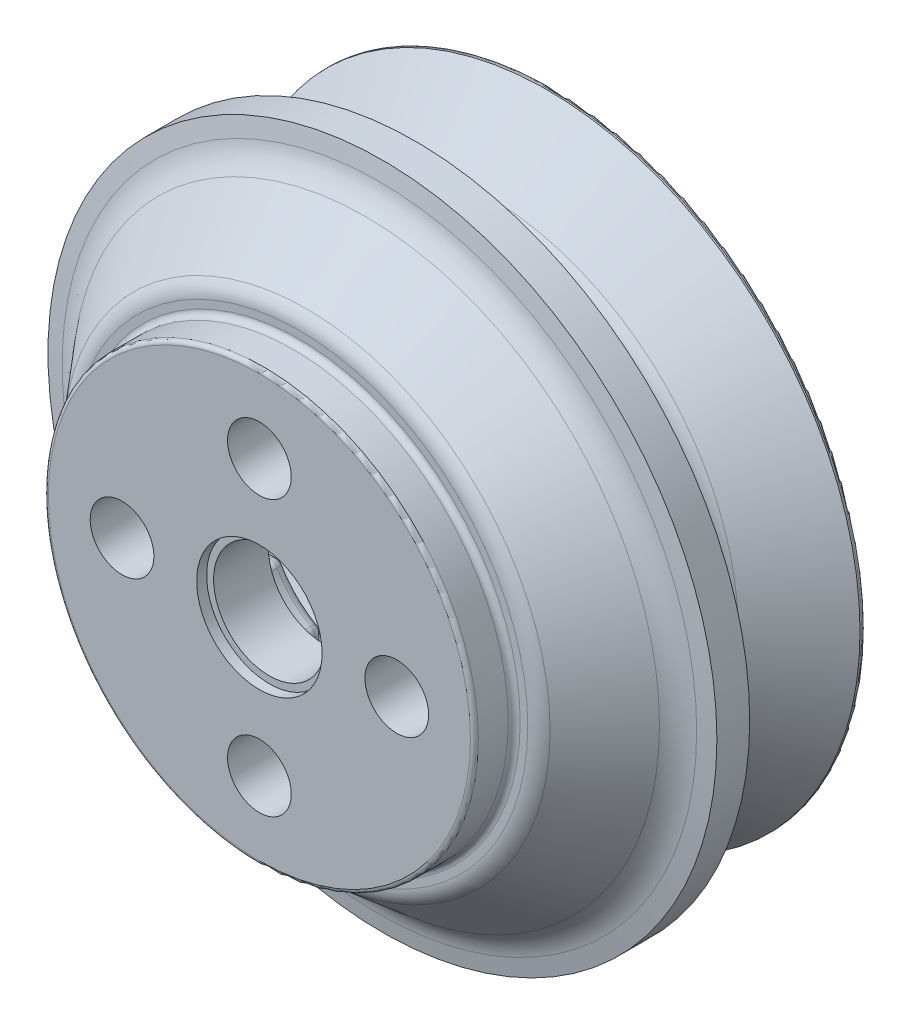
ISO-10303-21;
HEADER;
FILE_DESCRIPTION(('STEP AP214'),'2;1');
FILE_NAME('part.step','',(''),(''),'','','');
FILE_SCHEMA(('AUTOMOTIVE_DESIGN { 1 0 10303 214 1 1 1 1 }'));
ENDSEC;
DATA;
#1=APPLICATION_CONTEXT('core data for automotive mechanical design processes');
#2=APPLICATION_PROTOCOL_DEFINITION('international standard','automotive_design',2000,#1);
#3=PRODUCT_CONTEXT('',#1,'mechanical');
#4=PRODUCT('Part','Part','',(#3));
#5=PRODUCT_RELATED_PRODUCT_CATEGORY('part','',(#4));
#6=PRODUCT_DEFINITION_FORMATION('','',#4);
#7=PRODUCT_DEFINITION_CONTEXT('part definition',#1,'design');
#8=PRODUCT_DEFINITION('design','',#6,#7);
#9=PRODUCT_DEFINITION_SHAPE('','',#8);
#10=(LENGTH_UNIT() NAMED_UNIT(*) SI_UNIT(.MILLI.,.METRE.));
#11=(NAMED_UNIT(*) PLANE_ANGLE_UNIT() SI_UNIT($,.RADIAN.));
#12=(NAMED_UNIT(*) SI_UNIT($,.STERADIAN.) SOLID_ANGLE_UNIT());
#13=UNCERTAINTY_MEASURE_WITH_UNIT(LENGTH_MEASURE(1.E-05),#10,'distance_accuracy_value','');
#14=(GEOMETRIC_REPRESENTATION_CONTEXT(3) GLOBAL_UNCERTAINTY_ASSIGNED_CONTEXT((#13)) GLOBAL_UNIT_ASSIGNED_CONTEXT((#10,
#11,#12)) REPRESENTATION_CONTEXT('',''));
#15=CARTESIAN_POINT('',(0.,0.,0.));
#16=DIRECTION('',(0.,0.,1.));
#17=DIRECTION('',(1.,0.,0.));
#18=AXIS2_PLACEMENT_3D('',#15,#16,#17);
#19=CARTESIAN_POINT('',(0.,0.,-37.465));
#20=DIRECTION('',(0.,0.,-1.));
#21=DIRECTION('',(-1.,0.,0.));
#22=AXIS2_PLACEMENT_3D('',#19,#20,#21);
#23=CONICAL_SURFACE('',#22,38.4556,0.823796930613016);
#24=CARTESIAN_POINT('',(0.,0.,-37.465));
#25=DIRECTION('',(0.,0.,1.));
#26=DIRECTION('',(1.,0.,0.));
#27=AXIS2_PLACEMENT_3D('',#24,#25,#26);
#28=CIRCLE('',#27,38.4556);
#29=CARTESIAN_POINT('',(38.4556,0.,-37.465));
#30=VERTEX_POINT('',#29);
#31=EDGE_CURVE('E852',#30,#30,#28,.T.);
#32=ORIENTED_EDGE('',*,*,#31,.F.);
#33=EDGE_LOOP('',(#32));
#34=FACE_BOUND('',#33,.T.);
#35=CARTESIAN_POINT('',(0.,0.,-28.3594475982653));
#36=DIRECTION('',(0.,0.,1.));
#37=DIRECTION('',(1.,0.,0.));
#38=AXIS2_PLACEMENT_3D('',#35,#36,#37);
#39=CIRCLE('',#38,28.6224678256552);
#40=CARTESIAN_POINT('',(28.6224678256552,0.,-28.3594475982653));
#41=VERTEX_POINT('',#40);
#42=EDGE_CURVE('E10',#41,#41,#39,.T.);
#43=ORIENTED_EDGE('',*,*,#42,.T.);
#44=EDGE_LOOP('',(#43));
#45=FACE_BOUND('',#44,.T.);
#46=ADVANCED_FACE('F16',(#34,#45),#23,.F.);
#47=CARTESIAN_POINT('',(0.,0.,-13.335));
#48=DIRECTION('',(0.,0.,-1.));
#49=DIRECTION('',(-1.,0.,0.));
#50=AXIS2_PLACEMENT_3D('',#47,#48,#49);
#51=PLANE('',#50);
#52=DIRECTION('',(0.,-1.,0.));
#53=VECTOR('',#52,1.);
#54=CARTESIAN_POINT('',(6.223,23.654154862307,-13.335));
#55=LINE('',#54,#53);
#56=CARTESIAN_POINT('',(6.223,10.9249530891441,-13.335));
#57=VERTEX_POINT('',#56);
#58=CARTESIAN_POINT('',(6.223,22.1945899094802,-13.335));
#59=VERTEX_POINT('',#58);
#60=EDGE_CURVE('E552',#57,#59,#55,.F.);
#61=ORIENTED_EDGE('',*,*,#60,.T.);
#62=CARTESIAN_POINT('',(0.,0.,-13.335));
#63=DIRECTION('',(0.,0.,-1.));
#64=DIRECTION('',(-1.,0.,0.));
#65=AXIS2_PLACEMENT_3D('',#62,#63,#64);
#66=CIRCLE('',#65,23.0505);
#67=CARTESIAN_POINT('',(22.1945899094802,6.223,-13.335));
#68=VERTEX_POINT('',#67);
#69=EDGE_CURVE('E555',#59,#68,#66,.T.);
#70=ORIENTED_EDGE('',*,*,#69,.T.);
#71=DIRECTION('',(1.,0.,0.));
#72=VECTOR('',#71,1.);
#73=CARTESIAN_POINT('',(10.2390673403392,6.223,-13.335));
#74=LINE('',#73,#72);
#75=CARTESIAN_POINT('',(10.9249530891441,6.223,-13.335));
#76=VERTEX_POINT('',#75);
#77=EDGE_CURVE('E546',#68,#76,#74,.F.);
#78=ORIENTED_EDGE('',*,*,#77,.T.);
#79=CARTESIAN_POINT('',(0.,0.,-13.335));
#80=DIRECTION('',(0.,0.,-1.));
#81=DIRECTION('',(-1.,0.,0.));
#82=AXIS2_PLACEMENT_3D('',#79,#80,#81);
#83=CIRCLE('',#82,12.573);
#84=EDGE_CURVE('E549',#76,#57,#83,.F.);
#85=ORIENTED_EDGE('',*,*,#84,.T.);
#86=EDGE_LOOP('',(#61,#70,#78,#85));
#87=FACE_BOUND('',#86,.T.);
#88=ADVANCED_FACE('F835',(#87),#51,.T.);
#89=DIRECTION('',(1.,0.,0.));
#90=VECTOR('',#89,1.);
#91=CARTESIAN_POINT('',(-23.654154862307,6.223,-13.335));
#92=LINE('',#91,#90);
#93=CARTESIAN_POINT('',(-10.9249530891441,6.223,-13.335));
#94=VERTEX_POINT('',#93);
#95=CARTESIAN_POINT('',(-22.1945899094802,6.223,-13.335));
#96=VERTEX_POINT('',#95);
#97=EDGE_CURVE('E398',#94,#96,#92,.F.);
#98=ORIENTED_EDGE('',*,*,#97,.T.);
#99=CARTESIAN_POINT('',(0.,0.,-13.335));
#100=DIRECTION('',(0.,0.,-1.));
#101=DIRECTION('',(-1.,0.,0.));
#102=AXIS2_PLACEMENT_3D('',#99,#100,#101);
#103=CIRCLE('',#102,23.0505);
#104=CARTESIAN_POINT('',(-6.223,22.1945899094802,-13.335));
#105=VERTEX_POINT('',#104);
#106=EDGE_CURVE('E365',#96,#105,#103,.T.);
#107=ORIENTED_EDGE('',*,*,#106,.T.);
#108=DIRECTION('',(0.,1.,0.));
#109=VECTOR('',#108,1.);
#110=CARTESIAN_POINT('',(-6.223,10.2390673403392,-13.335));
#111=LINE('',#110,#109);
#112=CARTESIAN_POINT('',(-6.223,10.9249530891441,-13.335));
#113=VERTEX_POINT('',#112);
#114=EDGE_CURVE('E386',#105,#113,#111,.F.);
#115=ORIENTED_EDGE('',*,*,#114,.T.);
#116=CARTESIAN_POINT('',(0.,0.,-13.335));
#117=DIRECTION('',(0.,0.,-1.));
#118=DIRECTION('',(-1.,0.,0.));
#119=AXIS2_PLACEMENT_3D('',#116,#117,#118);
#120=CIRCLE('',#119,12.573);
#121=EDGE_CURVE('E393',#113,#94,#120,.F.);
#122=ORIENTED_EDGE('',*,*,#121,.T.);
#123=EDGE_LOOP('',(#98,#107,#115,#122));
#124=FACE_BOUND('',#123,.T.);
#125=ADVANCED_FACE('F396',(#124),#51,.T.);
#126=DIRECTION('',(0.,1.,0.));
#127=VECTOR('',#126,1.);
#128=CARTESIAN_POINT('',(-6.223,-23.654154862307,-13.335));
#129=LINE('',#128,#127);
#130=CARTESIAN_POINT('',(-6.223,-10.9249530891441,-13.335));
#131=VERTEX_POINT('',#130);
#132=CARTESIAN_POINT('',(-6.223,-22.1945899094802,-13.335));
#133=VERTEX_POINT('',#132);
#134=EDGE_CURVE('E452',#131,#133,#129,.F.);
#135=ORIENTED_EDGE('',*,*,#134,.T.);
#136=CARTESIAN_POINT('',(0.,0.,-13.335));
#137=DIRECTION('',(0.,0.,-1.));
#138=DIRECTION('',(-1.,0.,0.));
#139=AXIS2_PLACEMENT_3D('',#136,#137,#138);
#140=CIRCLE('',#139,23.0505);
#141=CARTESIAN_POINT('',(-22.1945899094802,-6.223,-13.335));
#142=VERTEX_POINT('',#141);
#143=EDGE_CURVE('E455',#133,#142,#140,.T.);
#144=ORIENTED_EDGE('',*,*,#143,.T.);
#145=DIRECTION('',(-1.,0.,0.));
#146=VECTOR('',#145,1.);
#147=CARTESIAN_POINT('',(-10.2390673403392,-6.223,-13.335));
#148=LINE('',#147,#146);
#149=CARTESIAN_POINT('',(-10.9249530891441,-6.223,-13.335));
#150=VERTEX_POINT('',#149);
#151=EDGE_CURVE('E446',#142,#150,#148,.F.);
#152=ORIENTED_EDGE('',*,*,#151,.T.);
#153=CARTESIAN_POINT('',(0.,0.,-13.335));
#154=DIRECTION('',(0.,0.,-1.));
#155=DIRECTION('',(-1.,0.,0.));
#156=AXIS2_PLACEMENT_3D('',#153,#154,#155);
#157=CIRCLE('',#156,12.573);
#158=EDGE_CURVE('E449',#150,#131,#157,.F.);
#159=ORIENTED_EDGE('',*,*,#158,.T.);
#160=EDGE_LOOP('',(#135,#144,#152,#159));
#161=FACE_BOUND('',#160,.T.);
#162=ADVANCED_FACE('F836',(#161),#51,.T.);
#163=CARTESIAN_POINT('',(0.,0.,-13.335));
#164=DIRECTION('',(0.,0.,1.));
#165=DIRECTION('',(1.,0.,0.));
#166=AXIS2_PLACEMENT_3D('',#163,#164,#165);
#167=CYLINDRICAL_SURFACE('',#166,24.1935);
#168=CARTESIAN_POINT('',(0.,0.,-12.192));
#169=DIRECTION('',(0.,0.,-1.));
#170=DIRECTION('',(-1.,0.,0.));
#171=AXIS2_PLACEMENT_3D('',#168,#169,#170);
#172=CIRCLE('',#171,24.1935);
#173=CARTESIAN_POINT('',(23.2951480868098,6.53157851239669,-12.192));
#174=VERTEX_POINT('',#173);
#175=CARTESIAN_POINT('',(6.53157851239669,23.2951480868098,-12.192));
#176=VERTEX_POINT('',#175);
#177=EDGE_CURVE('E562',#174,#176,#172,.F.);
#178=ORIENTED_EDGE('',*,*,#177,.T.);
#179=DIRECTION('',(0.,0.,1.));
#180=VECTOR('',#179,1.);
#181=CARTESIAN_POINT('',(6.5315785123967,23.2951480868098,-13.335));
#182=LINE('',#181,#180);
#183=CARTESIAN_POINT('',(6.53157851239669,23.2951480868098,-8.255));
#184=VERTEX_POINT('',#183);
#185=EDGE_CURVE('E566',#176,#184,#182,.T.);
#186=ORIENTED_EDGE('',*,*,#185,.T.);
#187=CARTESIAN_POINT('',(0.,0.,-8.255));
#188=DIRECTION('',(0.,0.,-1.));
#189=DIRECTION('',(-1.,0.,0.));
#190=AXIS2_PLACEMENT_3D('',#187,#188,#189);
#191=CIRCLE('',#190,24.1935);
#192=CARTESIAN_POINT('',(23.2951480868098,6.53157851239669,-8.255));
#193=VERTEX_POINT('',#192);
#194=EDGE_CURVE('E867',#184,#193,#191,.T.);
#195=ORIENTED_EDGE('',*,*,#194,.T.);
#196=DIRECTION('',(0.,0.,1.));
#197=VECTOR('',#196,1.);
#198=CARTESIAN_POINT('',(23.2951480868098,6.5315785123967,-13.335));
#199=LINE('',#198,#197);
#200=EDGE_CURVE('E559',#193,#174,#199,.F.);
#201=ORIENTED_EDGE('',*,*,#200,.T.);
#202=EDGE_LOOP('',(#178,#186,#195,#201));
#203=FACE_BOUND('',#202,.T.);
#204=ADVANCED_FACE('F1047',(#203),#167,.T.);
#205=CARTESIAN_POINT('',(-23.2951480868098,6.53157851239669,-8.255));
#206=VERTEX_POINT('',#205);
#207=CARTESIAN_POINT('',(-6.53157851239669,23.2951480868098,-8.255));
#208=VERTEX_POINT('',#207);
#209=EDGE_CURVE('E856',#206,#208,#191,.T.);
#210=ORIENTED_EDGE('',*,*,#209,.T.);
#211=DIRECTION('',(0.,0.,1.));
#212=VECTOR('',#211,1.);
#213=CARTESIAN_POINT('',(-6.5315785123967,23.2951480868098,-13.335));
#214=LINE('',#213,#212);
#215=CARTESIAN_POINT('',(-6.53157851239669,23.2951480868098,-12.192));
#216=VERTEX_POINT('',#215);
#217=EDGE_CURVE('E416',#208,#216,#214,.F.);
#218=ORIENTED_EDGE('',*,*,#217,.T.);
#219=CARTESIAN_POINT('',(0.,0.,-12.192));
#220=DIRECTION('',(0.,0.,-1.));
#221=DIRECTION('',(-1.,0.,0.));
#222=AXIS2_PLACEMENT_3D('',#219,#220,#221);
#223=CIRCLE('',#222,24.1935);
#224=CARTESIAN_POINT('',(-23.2951480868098,6.53157851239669,-12.192));
#225=VERTEX_POINT('',#224);
#226=EDGE_CURVE('E367',#216,#225,#223,.F.);
#227=ORIENTED_EDGE('',*,*,#226,.T.);
#228=DIRECTION('',(0.,0.,1.));
#229=VECTOR('',#228,1.);
#230=CARTESIAN_POINT('',(-23.2951480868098,6.5315785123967,-13.335));
#231=LINE('',#230,#229);
#232=EDGE_CURVE('E401',#225,#206,#231,.T.);
#233=ORIENTED_EDGE('',*,*,#232,.T.);
#234=EDGE_LOOP('',(#210,#218,#227,#233));
#235=FACE_BOUND('',#234,.T.);
#236=ADVANCED_FACE('F979',(#235),#167,.T.);
#237=CARTESIAN_POINT('',(-6.53157851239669,-23.2951480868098,-8.255));
#238=VERTEX_POINT('',#237);
#239=CARTESIAN_POINT('',(-23.2951480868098,-6.53157851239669,-8.255));
#240=VERTEX_POINT('',#239);
#241=EDGE_CURVE('E869',#238,#240,#191,.T.);
#242=ORIENTED_EDGE('',*,*,#241,.T.);
#243=DIRECTION('',(0.,0.,1.));
#244=VECTOR('',#243,1.);
#245=CARTESIAN_POINT('',(-23.2951480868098,-6.5315785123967,-13.335));
#246=LINE('',#245,#244);
#247=CARTESIAN_POINT('',(-23.2951480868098,-6.53157851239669,-12.192));
#248=VERTEX_POINT('',#247);
#249=EDGE_CURVE('E466',#240,#248,#246,.F.);
#250=ORIENTED_EDGE('',*,*,#249,.T.);
#251=CARTESIAN_POINT('',(0.,0.,-12.192));
#252=DIRECTION('',(0.,0.,-1.));
#253=DIRECTION('',(-1.,0.,0.));
#254=AXIS2_PLACEMENT_3D('',#251,#252,#253);
#255=CIRCLE('',#254,24.1935);
#256=CARTESIAN_POINT('',(-6.53157851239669,-23.2951480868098,-12.192));
#257=VERTEX_POINT('',#256);
#258=EDGE_CURVE('E462',#248,#257,#255,.F.);
#259=ORIENTED_EDGE('',*,*,#258,.T.);
#260=DIRECTION('',(0.,0.,1.));
#261=VECTOR('',#260,1.);
#262=CARTESIAN_POINT('',(-6.5315785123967,-23.2951480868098,-13.335));
#263=LINE('',#262,#261);
#264=EDGE_CURVE('E459',#257,#238,#263,.T.);
#265=ORIENTED_EDGE('',*,*,#264,.T.);
#266=EDGE_LOOP('',(#242,#250,#259,#265));
#267=FACE_BOUND('',#266,.T.);
#268=ADVANCED_FACE('F1143',(#267),#167,.T.);
#269=CARTESIAN_POINT('',(0.,0.,-13.335));
#270=DIRECTION('',(0.,0.,1.));
#271=DIRECTION('',(1.,0.,0.));
#272=AXIS2_PLACEMENT_3D('',#269,#270,#271);
#273=CYLINDRICAL_SURFACE('',#272,11.43);
#274=CARTESIAN_POINT('',(0.,0.,-8.255));
#275=DIRECTION('',(0.,0.,-1.));
#276=DIRECTION('',(-1.,0.,0.));
#277=AXIS2_PLACEMENT_3D('',#274,#275,#276);
#278=CIRCLE('',#277,11.43);
#279=CARTESIAN_POINT('',(9.93177553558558,5.65727272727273,-8.255));
#280=VERTEX_POINT('',#279);
#281=CARTESIAN_POINT('',(5.65727272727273,9.93177553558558,-8.255));
#282=VERTEX_POINT('',#281);
#283=EDGE_CURVE('E948',#280,#282,#278,.F.);
#284=ORIENTED_EDGE('',*,*,#283,.T.);
#285=DIRECTION('',(0.,0.,1.));
#286=VECTOR('',#285,1.);
#287=CARTESIAN_POINT('',(5.65727272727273,9.93177553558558,-13.335));
#288=LINE('',#287,#286);
#289=CARTESIAN_POINT('',(5.65727272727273,9.93177553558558,-12.192));
#290=VERTEX_POINT('',#289);
#291=EDGE_CURVE('E584',#282,#290,#288,.F.);
#292=ORIENTED_EDGE('',*,*,#291,.T.);
#293=CARTESIAN_POINT('',(0.,0.,-12.192));
#294=DIRECTION('',(0.,0.,-1.));
#295=DIRECTION('',(-1.,0.,0.));
#296=AXIS2_PLACEMENT_3D('',#293,#294,#295);
#297=CIRCLE('',#296,11.43);
#298=CARTESIAN_POINT('',(9.93177553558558,5.65727272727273,-12.192));
#299=VERTEX_POINT('',#298);
#300=EDGE_CURVE('E581',#290,#299,#297,.T.);
#301=ORIENTED_EDGE('',*,*,#300,.T.);
#302=DIRECTION('',(0.,0.,1.));
#303=VECTOR('',#302,1.);
#304=CARTESIAN_POINT('',(9.93177553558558,5.65727272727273,-13.335));
#305=LINE('',#304,#303);
#306=EDGE_CURVE('E578',#299,#280,#305,.T.);
#307=ORIENTED_EDGE('',*,*,#306,.T.);
#308=EDGE_LOOP('',(#284,#292,#301,#307));
#309=FACE_BOUND('',#308,.T.);
#310=ADVANCED_FACE('F1099',(#309),#273,.F.);
#311=CARTESIAN_POINT('',(-5.65727272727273,9.93177553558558,-8.255));
#312=VERTEX_POINT('',#311);
#313=CARTESIAN_POINT('',(-9.93177553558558,5.65727272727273,-8.255));
#314=VERTEX_POINT('',#313);
#315=EDGE_CURVE('E947',#312,#314,#278,.F.);
#316=ORIENTED_EDGE('',*,*,#315,.T.);
#317=DIRECTION('',(0.,0.,1.));
#318=VECTOR('',#317,1.);
#319=CARTESIAN_POINT('',(-9.93177553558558,5.65727272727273,-13.335));
#320=LINE('',#319,#318);
#321=CARTESIAN_POINT('',(-9.93177553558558,5.65727272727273,-12.192));
#322=VERTEX_POINT('',#321);
#323=EDGE_CURVE('E434',#314,#322,#320,.F.);
#324=ORIENTED_EDGE('',*,*,#323,.T.);
#325=CARTESIAN_POINT('',(0.,0.,-12.192));
#326=DIRECTION('',(0.,0.,-1.));
#327=DIRECTION('',(-1.,0.,0.));
#328=AXIS2_PLACEMENT_3D('',#325,#326,#327);
#329=CIRCLE('',#328,11.43);
#330=CARTESIAN_POINT('',(-5.65727272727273,9.93177553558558,-12.192));
#331=VERTEX_POINT('',#330);
#332=EDGE_CURVE('E431',#322,#331,#329,.T.);
#333=ORIENTED_EDGE('',*,*,#332,.T.);
#334=DIRECTION('',(0.,0.,1.));
#335=VECTOR('',#334,1.);
#336=CARTESIAN_POINT('',(-5.65727272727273,9.93177553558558,-13.335));
#337=LINE('',#336,#335);
#338=EDGE_CURVE('E428',#331,#312,#337,.T.);
#339=ORIENTED_EDGE('',*,*,#338,.T.);
#340=EDGE_LOOP('',(#316,#324,#333,#339));
#341=FACE_BOUND('',#340,.T.);
#342=ADVANCED_FACE('F1154',(#341),#273,.F.);
#343=CARTESIAN_POINT('',(0.,0.,-12.192));
#344=DIRECTION('',(0.,0.,-1.));
#345=DIRECTION('',(-1.,0.,0.));
#346=AXIS2_PLACEMENT_3D('',#343,#344,#345);
#347=CIRCLE('',#346,11.43);
#348=CARTESIAN_POINT('',(-5.65727272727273,-9.93177553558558,-12.192));
#349=VERTEX_POINT('',#348);
#350=CARTESIAN_POINT('',(-9.93177553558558,-5.65727272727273,-12.192));
#351=VERTEX_POINT('',#350);
#352=EDGE_CURVE('E481',#349,#351,#347,.T.);
#353=ORIENTED_EDGE('',*,*,#352,.T.);
#354=DIRECTION('',(0.,0.,1.));
#355=VECTOR('',#354,1.);
#356=CARTESIAN_POINT('',(-9.93177553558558,-5.65727272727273,-13.335));
#357=LINE('',#356,#355);
#358=CARTESIAN_POINT('',(-9.93177553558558,-5.65727272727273,-8.255));
#359=VERTEX_POINT('',#358);
#360=EDGE_CURVE('E484',#351,#359,#357,.T.);
#361=ORIENTED_EDGE('',*,*,#360,.T.);
#362=CARTESIAN_POINT('',(-5.65727272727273,-9.93177553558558,-8.255));
#363=VERTEX_POINT('',#362);
#364=EDGE_CURVE('E394',#359,#363,#278,.F.);
#365=ORIENTED_EDGE('',*,*,#364,.T.);
#366=DIRECTION('',(0.,0.,1.));
#367=VECTOR('',#366,1.);
#368=CARTESIAN_POINT('',(-5.65727272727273,-9.93177553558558,-13.335));
#369=LINE('',#368,#367);
#370=EDGE_CURVE('E478',#363,#349,#369,.F.);
#371=ORIENTED_EDGE('',*,*,#370,.T.);
#372=EDGE_LOOP('',(#353,#361,#365,#371));
#373=FACE_BOUND('',#372,.T.);
#374=ADVANCED_FACE('F1141',(#373),#273,.F.);
#375=CARTESIAN_POINT('',(0.,0.,-37.465));
#376=DIRECTION('',(0.,0.,1.));
#377=DIRECTION('',(1.,0.,0.));
#378=AXIS2_PLACEMENT_3D('',#375,#376,#377);
#379=PLANE('',#378);
#380=CARTESIAN_POINT('',(0.,0.,-37.465));
#381=DIRECTION('',(0.,0.,1.));
#382=DIRECTION('',(1.,0.,0.));
#383=AXIS2_PLACEMENT_3D('',#380,#381,#382);
#384=CIRCLE('',#383,39.37);
#385=CARTESIAN_POINT('',(39.37,0.,-37.465));
#386=VERTEX_POINT('',#385);
#387=EDGE_CURVE('E943',#386,#386,#384,.F.);
#388=ORIENTED_EDGE('',*,*,#387,.T.);
#389=EDGE_LOOP('',(#388));
#390=FACE_BOUND('',#389,.T.);
#391=ORIENTED_EDGE('',*,*,#31,.T.);
#392=EDGE_LOOP('',(#391));
#393=FACE_BOUND('',#392,.T.);
#394=ADVANCED_FACE('F1498',(#390,#393),#379,.F.);
#395=CARTESIAN_POINT('',(0.,0.,-37.465));
#396=DIRECTION('',(0.,0.,1.));
#397=DIRECTION('',(1.,0.,0.));
#398=AXIS2_PLACEMENT_3D('',#395,#396,#397);
#399=CYLINDRICAL_SURFACE('',#398,42.672);
#400=CARTESIAN_POINT('',(0.,0.,-15.6972));
#401=DIRECTION('',(0.,0.,1.));
#402=DIRECTION('',(1.,0.,0.));
#403=AXIS2_PLACEMENT_3D('',#400,#401,#402);
#404=CIRCLE('',#403,42.672);
#405=CARTESIAN_POINT('',(42.672,0.,-15.6972));
#406=VERTEX_POINT('',#405);
#407=EDGE_CURVE('E919',#406,#406,#404,.T.);
#408=ORIENTED_EDGE('',*,*,#407,.F.);
#409=EDGE_LOOP('',(#408));
#410=FACE_BOUND('',#409,.T.);
#411=CARTESIAN_POINT('',(0.,0.,-19.8815210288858));
#412=DIRECTION('',(0.,0.,1.));
#413=DIRECTION('',(1.,0.,0.));
#414=AXIS2_PLACEMENT_3D('',#411,#412,#413);
#415=CIRCLE('',#414,42.672);
#416=CARTESIAN_POINT('',(42.672,0.,-19.8815210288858));
#417=VERTEX_POINT('',#416);
#418=EDGE_CURVE('E879',#417,#417,#415,.T.);
#419=ORIENTED_EDGE('',*,*,#418,.T.);
#420=EDGE_LOOP('',(#419));
#421=FACE_BOUND('',#420,.T.);
#422=ADVANCED_FACE('F1487',(#410,#421),#399,.T.);
#423=CARTESIAN_POINT('',(0.,-15.5702138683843,-5.08));
#424=DIRECTION('',(0.,0.,-1.));
#425=DIRECTION('',(-1.,0.,0.));
#426=AXIS2_PLACEMENT_3D('',#423,#424,#425);
#427=PLANE('',#426);
#428=CARTESIAN_POINT('',(0.,0.,-5.08));
#429=DIRECTION('',(0.,0.,-1.));
#430=DIRECTION('',(-1.,0.,0.));
#431=AXIS2_PLACEMENT_3D('',#428,#429,#430);
#432=CIRCLE('',#431,28.194);
#433=CARTESIAN_POINT('',(-28.194,0.,-5.08));
#434=VERTEX_POINT('',#433);
#435=EDGE_CURVE('E935',#434,#434,#432,.T.);
#436=ORIENTED_EDGE('',*,*,#435,.T.);
#437=EDGE_LOOP('',(#436));
#438=FACE_BOUND('',#437,.T.);
#439=CARTESIAN_POINT('',(0.,0.,-5.08));
#440=DIRECTION('',(0.,0.,1.));
#441=DIRECTION('',(1.,0.,0.));
#442=AXIS2_PLACEMENT_3D('',#439,#440,#441);
#443=CIRCLE('',#442,29.1592);
#444=CARTESIAN_POINT('',(29.1592,0.,-5.08));
#445=VERTEX_POINT('',#444);
#446=EDGE_CURVE('E903',#445,#445,#443,.T.);
#447=ORIENTED_EDGE('',*,*,#446,.T.);
#448=EDGE_LOOP('',(#447));
#449=FACE_BOUND('',#448,.T.);
#450=ADVANCED_FACE('F1477',(#438,#449),#427,.F.);
#451=CARTESIAN_POINT('',(0.,0.,0.));
#452=DIRECTION('',(0.,0.,1.));
#453=DIRECTION('',(1.,0.,0.));
#454=AXIS2_PLACEMENT_3D('',#451,#452,#453);
#455=CYLINDRICAL_SURFACE('',#454,27.432);
#456=CARTESIAN_POINT('',(0.,0.,-4.318));
#457=DIRECTION('',(0.,0.,-1.));
#458=DIRECTION('',(-1.,0.,0.));
#459=AXIS2_PLACEMENT_3D('',#456,#457,#458);
#460=CIRCLE('',#459,27.432);
#461=CARTESIAN_POINT('',(-27.432,0.,-4.318));
#462=VERTEX_POINT('',#461);
#463=EDGE_CURVE('E931',#462,#462,#460,.F.);
#464=ORIENTED_EDGE('',*,*,#463,.T.);
#465=EDGE_LOOP('',(#464));
#466=FACE_BOUND('',#465,.T.);
#467=CARTESIAN_POINT('',(0.,0.,-0.508));
#468=DIRECTION('',(0.,0.,1.));
#469=DIRECTION('',(1.,0.,0.));
#470=AXIS2_PLACEMENT_3D('',#467,#468,#469);
#471=CIRCLE('',#470,27.432);
#472=CARTESIAN_POINT('',(27.432,0.,-0.508));
#473=VERTEX_POINT('',#472);
#474=EDGE_CURVE('E927',#473,#473,#471,.F.);
#475=ORIENTED_EDGE('',*,*,#474,.T.);
#476=EDGE_LOOP('',(#475));
#477=FACE_BOUND('',#476,.T.);
#478=ADVANCED_FACE('F1466',(#466,#477),#455,.T.);
#479=CARTESIAN_POINT('',(0.,0.,-15.6972));
#480=DIRECTION('',(0.,0.,-1.));
#481=DIRECTION('',(-1.,0.,0.));
#482=AXIS2_PLACEMENT_3D('',#479,#480,#481);
#483=CONICAL_SURFACE('',#482,42.672,1.39626340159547);
#484=CARTESIAN_POINT('',(0.,0.,-15.3106208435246));
#485=DIRECTION('',(0.,0.,1.));
#486=DIRECTION('',(1.,0.,0.));
#487=AXIS2_PLACEMENT_3D('',#484,#485,#486);
#488=CIRCLE('',#487,40.4796006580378);
#489=CARTESIAN_POINT('',(40.4796006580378,0.,-15.3106208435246));
#490=VERTEX_POINT('',#489);
#491=EDGE_CURVE('E915',#490,#490,#488,.T.);
#492=ORIENTED_EDGE('',*,*,#491,.F.);
#493=EDGE_LOOP('',(#492));
#494=FACE_BOUND('',#493,.T.);
#495=ORIENTED_EDGE('',*,*,#407,.T.);
#496=EDGE_LOOP('',(#495));
#497=FACE_BOUND('',#496,.T.);
#498=ADVANCED_FACE('F1456',(#494,#497),#483,.T.);
#499=CARTESIAN_POINT('',(0.,0.,-10.3077974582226));
#500=DIRECTION('',(0.,0.,1.));
#501=DIRECTION('',(1.,0.,0.));
#502=AXIS2_PLACEMENT_3D('',#499,#500,#501);
#503=TOROIDAL_SURFACE('',#502,41.3617334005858,5.08);
#504=ORIENTED_EDGE('',*,*,#491,.T.);
#505=EDGE_LOOP('',(#504));
#506=FACE_BOUND('',#505,.T.);
#507=CARTESIAN_POINT('',(0.,0.,-13.5731585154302));
#508=DIRECTION('',(0.,0.,1.));
#509=DIRECTION('',(1.,0.,0.));
#510=AXIS2_PLACEMENT_3D('',#507,#508,#509);
#511=CIRCLE('',#510,37.4702276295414);
#512=CARTESIAN_POINT('',(37.4702276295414,0.,-13.5731585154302));
#513=VERTEX_POINT('',#512);
#514=EDGE_CURVE('E911',#513,#513,#511,.T.);
#515=ORIENTED_EDGE('',*,*,#514,.F.);
#516=EDGE_LOOP('',(#515));
#517=FACE_BOUND('',#516,.T.);
#518=ADVANCED_FACE('F1446',(#506,#517),#503,.F.);
#519=CARTESIAN_POINT('',(0.,0.,-13.5731585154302));
#520=DIRECTION('',(0.,0.,-1.));
#521=DIRECTION('',(-1.,0.,0.));
#522=AXIS2_PLACEMENT_3D('',#519,#520,#521);
#523=CONICAL_SURFACE('',#522,37.4702276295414,0.698131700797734);
#524=CARTESIAN_POINT('',(0.,0.,-5.98731947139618));
#525=DIRECTION('',(0.,0.,1.));
#526=DIRECTION('',(1.,0.,0.));
#527=AXIS2_PLACEMENT_3D('',#524,#525,#526);
#528=CIRCLE('',#527,31.1049528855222);
#529=CARTESIAN_POINT('',(31.1049528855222,0.,-5.98731947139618));
#530=VERTEX_POINT('',#529);
#531=EDGE_CURVE('E907',#530,#530,#528,.T.);
#532=ORIENTED_EDGE('',*,*,#531,.F.);
#533=EDGE_LOOP('',(#532));
#534=FACE_BOUND('',#533,.T.);
#535=ORIENTED_EDGE('',*,*,#514,.T.);
#536=EDGE_LOOP('',(#535));
#537=FACE_BOUND('',#536,.T.);
#538=ADVANCED_FACE('F1435',(#534,#537),#523,.T.);
#539=CARTESIAN_POINT('',(0.,0.,-7.62));
#540=DIRECTION('',(0.,0.,1.));
#541=DIRECTION('',(1.,0.,0.));
#542=AXIS2_PLACEMENT_3D('',#539,#540,#541);
#543=TOROIDAL_SURFACE('',#542,29.1592,2.54);
#544=ORIENTED_EDGE('',*,*,#531,.T.);
#545=EDGE_LOOP('',(#544));
#546=FACE_BOUND('',#545,.T.);
#547=ORIENTED_EDGE('',*,*,#446,.F.);
#548=EDGE_LOOP('',(#547));
#549=FACE_BOUND('',#548,.T.);
#550=ADVANCED_FACE('F1424',(#546,#549),#543,.T.);
#551=CARTESIAN_POINT('',(0.,0.,0.));
#552=DIRECTION('',(0.,0.,1.));
#553=DIRECTION('',(1.,0.,0.));
#554=AXIS2_PLACEMENT_3D('',#551,#552,#553);
#555=PLANE('',#554);
#556=CARTESIAN_POINT('',(-17.526,1.83575105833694E-13,0.));
#557=DIRECTION('',(0.,0.,1.));
#558=DIRECTION('',(0.,1.,0.));
#559=AXIS2_PLACEMENT_3D('',#556,#557,#558);
#560=CIRCLE('',#559,4.064);
#561=CARTESIAN_POINT('',(-17.526,4.06400000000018,0.));
#562=VERTEX_POINT('',#561);
#563=EDGE_CURVE('E2526',#562,#562,#560,.T.);
#564=ORIENTED_EDGE('',*,*,#563,.F.);
#565=EDGE_LOOP('',(#564));
#566=FACE_BOUND('',#565,.T.);
#567=CARTESIAN_POINT('',(-1.22383403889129E-13,-17.526,0.));
#568=DIRECTION('',(0.,0.,1.));
#569=DIRECTION('',(-1.,0.,0.));
#570=AXIS2_PLACEMENT_3D('',#567,#568,#569);
#571=CIRCLE('',#570,4.064);
#572=CARTESIAN_POINT('',(-4.06400000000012,-17.526,0.));
#573=VERTEX_POINT('',#572);
#574=EDGE_CURVE('E2539',#573,#573,#571,.T.);
#575=ORIENTED_EDGE('',*,*,#574,.F.);
#576=EDGE_LOOP('',(#575));
#577=FACE_BOUND('',#576,.T.);
#578=CARTESIAN_POINT('',(17.526,0.,0.));
#579=DIRECTION('',(0.,0.,1.));
#580=DIRECTION('',(0.,-1.,0.));
#581=AXIS2_PLACEMENT_3D('',#578,#579,#580);
#582=CIRCLE('',#581,4.064);
#583=CARTESIAN_POINT('',(17.526,-4.06400000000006,0.));
#584=VERTEX_POINT('',#583);
#585=EDGE_CURVE('E2146',#584,#584,#582,.T.);
#586=ORIENTED_EDGE('',*,*,#585,.F.);
#587=EDGE_LOOP('',(#586));
#588=FACE_BOUND('',#587,.T.);
#589=CARTESIAN_POINT('',(0.,17.526,0.));
#590=DIRECTION('',(0.,0.,1.));
#591=DIRECTION('',(1.,0.,0.));
#592=AXIS2_PLACEMENT_3D('',#589,#590,#591);
#593=CIRCLE('',#592,4.064);
#594=CARTESIAN_POINT('',(4.064,17.526,0.));
#595=VERTEX_POINT('',#594);
#596=EDGE_CURVE('E2308',#595,#595,#593,.T.);
#597=ORIENTED_EDGE('',*,*,#596,.F.);
#598=EDGE_LOOP('',(#597));
#599=FACE_BOUND('',#598,.T.);
#600=CARTESIAN_POINT('',(0.,0.,0.));
#601=DIRECTION('',(0.,0.,1.));
#602=DIRECTION('',(1.,0.,0.));
#603=AXIS2_PLACEMENT_3D('',#600,#601,#602);
#604=CIRCLE('',#603,8.001);
#605=CARTESIAN_POINT('',(8.001,0.,0.));
#606=VERTEX_POINT('',#605);
#607=EDGE_CURVE('E2530',#606,#606,#604,.T.);
#608=ORIENTED_EDGE('',*,*,#607,.F.);
#609=EDGE_LOOP('',(#608));
#610=FACE_BOUND('',#609,.T.);
#611=CARTESIAN_POINT('',(0.,0.,0.));
#612=DIRECTION('',(0.,0.,1.));
#613=DIRECTION('',(1.,0.,0.));
#614=AXIS2_PLACEMENT_3D('',#611,#612,#613);
#615=CIRCLE('',#614,26.924);
#616=CARTESIAN_POINT('',(26.924,0.,0.));
#617=VERTEX_POINT('',#616);
#618=EDGE_CURVE('E923',#617,#617,#615,.T.);
#619=ORIENTED_EDGE('',*,*,#618,.T.);
#620=EDGE_LOOP('',(#619));
#621=FACE_BOUND('',#620,.T.);
#622=ADVANCED_FACE('F1413',(#566,#577,#588,#599,#610,#621),#555,.T.);
#623=CARTESIAN_POINT('',(0.,0.,-0.508));
#624=DIRECTION('',(0.,0.,1.));
#625=DIRECTION('',(1.,0.,0.));
#626=AXIS2_PLACEMENT_3D('',#623,#624,#625);
#627=TOROIDAL_SURFACE('',#626,26.924,0.508);
#628=ORIENTED_EDGE('',*,*,#474,.F.);
#629=EDGE_LOOP('',(#628));
#630=FACE_BOUND('',#629,.T.);
#631=ORIENTED_EDGE('',*,*,#618,.F.);
#632=EDGE_LOOP('',(#631));
#633=FACE_BOUND('',#632,.T.);
#634=ADVANCED_FACE('F1401',(#630,#633),#627,.T.);
#635=CARTESIAN_POINT('',(0.,0.,-4.318));
#636=DIRECTION('',(0.,0.,-1.));
#637=DIRECTION('',(-1.,0.,0.));
#638=AXIS2_PLACEMENT_3D('',#635,#636,#637);
#639=TOROIDAL_SURFACE('',#638,28.194,0.762);
#640=ORIENTED_EDGE('',*,*,#435,.F.);
#641=EDGE_LOOP('',(#640));
#642=FACE_BOUND('',#641,.T.);
#643=ORIENTED_EDGE('',*,*,#463,.F.);
#644=EDGE_LOOP('',(#643));
#645=FACE_BOUND('',#644,.T.);
#646=ADVANCED_FACE('F1390',(#642,#645),#639,.F.);
#647=CARTESIAN_POINT('',(0.,0.,0.));
#648=DIRECTION('',(0.,0.,1.));
#649=DIRECTION('',(1.,0.,0.));
#650=AXIS2_PLACEMENT_3D('',#647,#648,#649);
#651=CYLINDRICAL_SURFACE('',#650,39.878);
#652=CARTESIAN_POINT('',(0.,0.,-36.957));
#653=DIRECTION('',(0.,0.,1.));
#654=DIRECTION('',(1.,0.,0.));
#655=AXIS2_PLACEMENT_3D('',#652,#653,#654);
#656=CIRCLE('',#655,39.878);
#657=CARTESIAN_POINT('',(39.878,0.,-36.957));
#658=VERTEX_POINT('',#657);
#659=EDGE_CURVE('E939',#658,#658,#656,.T.);
#660=ORIENTED_EDGE('',*,*,#659,.T.);
#661=EDGE_LOOP('',(#660));
#662=FACE_BOUND('',#661,.T.);
#663=CARTESIAN_POINT('',(0.,0.,-36.7538));
#664=DIRECTION('',(0.,0.,1.));
#665=DIRECTION('',(1.,0.,0.));
#666=AXIS2_PLACEMENT_3D('',#663,#664,#665);
#667=CIRCLE('',#666,39.878);
#668=CARTESIAN_POINT('',(39.878,0.,-36.7538));
#669=VERTEX_POINT('',#668);
#670=EDGE_CURVE('E899',#669,#669,#667,.T.);
#671=ORIENTED_EDGE('',*,*,#670,.F.);
#672=EDGE_LOOP('',(#671));
#673=FACE_BOUND('',#672,.T.);
#674=ADVANCED_FACE('F1380',(#662,#673),#651,.T.);
#675=CARTESIAN_POINT('',(0.,0.,-28.986766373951));
#676=DIRECTION('',(0.,0.,-1.));
#677=DIRECTION('',(-1.,0.,0.));
#678=AXIS2_PLACEMENT_3D('',#675,#676,#677);
#679=CONICAL_SURFACE('',#678,32.110966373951,0.78539816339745);
#680=ORIENTED_EDGE('',*,*,#670,.T.);
#681=EDGE_LOOP('',(#680));
#682=FACE_BOUND('',#681,.T.);
#683=CARTESIAN_POINT('',(0.,0.,-28.986766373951));
#684=DIRECTION('',(0.,0.,1.));
#685=DIRECTION('',(1.,0.,0.));
#686=AXIS2_PLACEMENT_3D('',#683,#684,#685);
#687=CIRCLE('',#686,32.110966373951);
#688=CARTESIAN_POINT('',(32.110966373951,0.,-28.986766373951));
#689=VERTEX_POINT('',#688);
#690=EDGE_CURVE('E895',#689,#689,#687,.T.);
#691=ORIENTED_EDGE('',*,*,#690,.F.);
#692=EDGE_LOOP('',(#691));
#693=FACE_BOUND('',#692,.T.);
#694=ADVANCED_FACE('F1368',(#682,#693),#679,.T.);
#695=CARTESIAN_POINT('',(0.,0.,-27.3703202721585));
#696=DIRECTION('',(0.,0.,1.));
#697=DIRECTION('',(1.,0.,0.));
#698=AXIS2_PLACEMENT_3D('',#695,#696,#697);
#699=TOROIDAL_SURFACE('',#698,33.7274124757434,2.286);
#700=ORIENTED_EDGE('',*,*,#690,.T.);
#701=EDGE_LOOP('',(#700));
#702=FACE_BOUND('',#701,.T.);
#703=CARTESIAN_POINT('',(0.,0.,-25.6191426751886));
#704=DIRECTION('',(0.,0.,1.));
#705=DIRECTION('',(1.,0.,0.));
#706=AXIS2_PLACEMENT_3D('',#703,#704,#705);
#707=CIRCLE('',#706,32.258);
#708=CARTESIAN_POINT('',(32.258,0.,-25.6191426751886));
#709=VERTEX_POINT('',#708);
#710=EDGE_CURVE('E891',#709,#709,#707,.T.);
#711=ORIENTED_EDGE('',*,*,#710,.F.);
#712=EDGE_LOOP('',(#711));
#713=FACE_BOUND('',#712,.T.);
#714=ADVANCED_FACE('F1355',(#702,#713),#699,.F.);
#715=CARTESIAN_POINT('',(0.,0.,-21.0700152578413));
#716=DIRECTION('',(0.,0.,1.));
#717=DIRECTION('',(1.,0.,0.));
#718=AXIS2_PLACEMENT_3D('',#715,#716,#717);
#719=CONICAL_SURFACE('',#718,37.6794389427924,0.872664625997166);
#720=ORIENTED_EDGE('',*,*,#710,.T.);
#721=EDGE_LOOP('',(#720));
#722=FACE_BOUND('',#721,.T.);
#723=CARTESIAN_POINT('',(0.,0.,-21.0700152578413));
#724=DIRECTION('',(0.,0.,1.));
#725=DIRECTION('',(1.,0.,0.));
#726=AXIS2_PLACEMENT_3D('',#723,#724,#725);
#727=CIRCLE('',#726,37.6794389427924);
#728=CARTESIAN_POINT('',(37.6794389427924,0.,-21.0700152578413));
#729=VERTEX_POINT('',#728);
#730=EDGE_CURVE('E887',#729,#729,#727,.T.);
#731=ORIENTED_EDGE('',*,*,#730,.F.);
#732=EDGE_LOOP('',(#731));
#733=FACE_BOUND('',#732,.T.);
#734=ADVANCED_FACE('F1343',(#722,#733),#719,.T.);
#735=CARTESIAN_POINT('',(0.,0.,-24.9615210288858));
#736=DIRECTION('',(0.,0.,1.));
#737=DIRECTION('',(1.,0.,0.));
#738=AXIS2_PLACEMENT_3D('',#735,#736,#737);
#739=TOROIDAL_SURFACE('',#738,40.9448,5.08);
#740=ORIENTED_EDGE('',*,*,#730,.T.);
#741=EDGE_LOOP('',(#740));
#742=FACE_BOUND('',#741,.T.);
#743=CARTESIAN_POINT('',(0.,0.,-19.8815210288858));
#744=DIRECTION('',(0.,0.,1.));
#745=DIRECTION('',(1.,0.,0.));
#746=AXIS2_PLACEMENT_3D('',#743,#744,#745);
#747=CIRCLE('',#746,40.9448);
#748=CARTESIAN_POINT('',(40.9448,0.,-19.8815210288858));
#749=VERTEX_POINT('',#748);
#750=EDGE_CURVE('E883',#749,#749,#747,.T.);
#751=ORIENTED_EDGE('',*,*,#750,.F.);
#752=EDGE_LOOP('',(#751));
#753=FACE_BOUND('',#752,.T.);
#754=ADVANCED_FACE('F1331',(#742,#753),#739,.F.);
#755=CARTESIAN_POINT('',(0.,42.672,-19.8815210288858));
#756=DIRECTION('',(0.,0.,-1.));
#757=DIRECTION('',(-1.,0.,0.));
#758=AXIS2_PLACEMENT_3D('',#755,#756,#757);
#759=PLANE('',#758);
#760=ORIENTED_EDGE('',*,*,#750,.T.);
#761=EDGE_LOOP('',(#760));
#762=FACE_BOUND('',#761,.T.);
#763=ORIENTED_EDGE('',*,*,#418,.F.);
#764=EDGE_LOOP('',(#763));
#765=FACE_BOUND('',#764,.T.);
#766=ADVANCED_FACE('F1320',(#762,#765),#759,.T.);
#767=CARTESIAN_POINT('',(0.,0.,-36.957));
#768=DIRECTION('',(0.,0.,1.));
#769=DIRECTION('',(1.,0.,0.));
#770=AXIS2_PLACEMENT_3D('',#767,#768,#769);
#771=TOROIDAL_SURFACE('',#770,39.37,0.508);
#772=ORIENTED_EDGE('',*,*,#387,.F.);
#773=EDGE_LOOP('',(#772));
#774=FACE_BOUND('',#773,.T.);
#775=ORIENTED_EDGE('',*,*,#659,.F.);
#776=EDGE_LOOP('',(#775));
#777=FACE_BOUND('',#776,.T.);
#778=ADVANCED_FACE('F1308',(#774,#777),#771,.T.);
#779=CARTESIAN_POINT('',(0.,0.,-17.399));
#780=DIRECTION('',(0.,0.,-1.));
#781=DIRECTION('',(-1.,0.,0.));
#782=AXIS2_PLACEMENT_3D('',#779,#780,#781);
#783=CONICAL_SURFACE('',#782,37.2872,0.635146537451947);
#784=CARTESIAN_POINT('',(0.,0.,-8.255));
#785=DIRECTION('',(0.,0.,1.));
#786=DIRECTION('',(1.,0.,0.));
#787=AXIS2_PLACEMENT_3D('',#784,#785,#786);
#788=CIRCLE('',#787,30.547825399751);
#789=CARTESIAN_POINT('',(30.547825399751,0.,-8.255));
#790=VERTEX_POINT('',#789);
#791=EDGE_CURVE('E875',#790,#790,#788,.T.);
#792=ORIENTED_EDGE('',*,*,#791,.T.);
#793=EDGE_LOOP('',(#792));
#794=FACE_BOUND('',#793,.T.);
#795=CARTESIAN_POINT('',(0.,0.,-17.399));
#796=DIRECTION('',(0.,0.,1.));
#797=DIRECTION('',(1.,0.,0.));
#798=AXIS2_PLACEMENT_3D('',#795,#796,#797);
#799=CIRCLE('',#798,37.2872);
#800=CARTESIAN_POINT('',(37.2872,0.,-17.399));
#801=VERTEX_POINT('',#800);
#802=EDGE_CURVE('E863',#801,#801,#799,.T.);
#803=ORIENTED_EDGE('',*,*,#802,.F.);
#804=EDGE_LOOP('',(#803));
#805=FACE_BOUND('',#804,.T.);
#806=ADVANCED_FACE('F1294',(#794,#805),#783,.F.);
#807=CARTESIAN_POINT('',(0.,0.,-17.6879416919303));
#808=DIRECTION('',(0.,0.,1.));
#809=DIRECTION('',(1.,0.,0.));
#810=AXIS2_PLACEMENT_3D('',#807,#808,#809);
#811=TOROIDAL_SURFACE('',#810,36.8951632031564,0.487011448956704);
#812=ORIENTED_EDGE('',*,*,#802,.T.);
#813=EDGE_LOOP('',(#812));
#814=FACE_BOUND('',#813,.T.);
#815=CARTESIAN_POINT('',(0.,0.,-18.0610141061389));
#816=DIRECTION('',(0.,0.,1.));
#817=DIRECTION('',(1.,0.,0.));
#818=AXIS2_PLACEMENT_3D('',#815,#816,#817);
#819=CIRCLE('',#818,37.2082081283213);
#820=CARTESIAN_POINT('',(37.2082081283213,0.,-18.0610141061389));
#821=VERTEX_POINT('',#820);
#822=EDGE_CURVE('E855',#821,#821,#819,.T.);
#823=ORIENTED_EDGE('',*,*,#822,.F.);
#824=EDGE_LOOP('',(#823));
#825=FACE_BOUND('',#824,.T.);
#826=ADVANCED_FACE('F837',(#814,#825),#811,.F.);
#827=CARTESIAN_POINT('',(0.,0.,-24.301759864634));
#828=DIRECTION('',(0.,0.,1.));
#829=DIRECTION('',(1.,0.,0.));
#830=AXIS2_PLACEMENT_3D('',#827,#828,#829);
#831=CONICAL_SURFACE('',#830,29.7707769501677,0.872664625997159);
#832=ORIENTED_EDGE('',*,*,#822,.T.);
#833=EDGE_LOOP('',(#832));
#834=FACE_BOUND('',#833,.T.);
#835=CARTESIAN_POINT('',(0.,0.,-26.7362042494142));
#836=DIRECTION('',(0.,0.,-1.));
#837=DIRECTION('',(-1.,0.,0.));
#838=AXIS2_PLACEMENT_3D('',#835,#836,#837);
#839=CIRCLE('',#838,26.8695191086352);
#840=CARTESIAN_POINT('',(-26.8695191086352,0.,-26.7362042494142));
#841=VERTEX_POINT('',#840);
#842=EDGE_CURVE('E25',#841,#841,#839,.T.);
#843=ORIENTED_EDGE('',*,*,#842,.T.);
#844=EDGE_LOOP('',(#843));
#845=FACE_BOUND('',#844,.T.);
#846=ADVANCED_FACE('F819',(#834,#845),#831,.F.);
#847=ORIENTED_EDGE('',*,*,#42,.F.);
#848=EDGE_LOOP('',(#847));
#849=FACE_BOUND('',#848,.T.);
#850=ORIENTED_EDGE('',*,*,#842,.F.);
#851=EDGE_LOOP('',(#850));
#852=FACE_BOUND('',#851,.T.);
#853=ADVANCED_FACE('F821',(#849,#852),#23,.F.);
#854=DIRECTION('',(-1.,0.,0.));
#855=VECTOR('',#854,1.);
#856=CARTESIAN_POINT('',(23.654154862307,-6.223,-13.335));
#857=LINE('',#856,#855);
#858=CARTESIAN_POINT('',(10.9249530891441,-6.223,-13.335));
#859=VERTEX_POINT('',#858);
#860=CARTESIAN_POINT('',(22.1945899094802,-6.223,-13.335));
#861=VERTEX_POINT('',#860);
#862=EDGE_CURVE('E502',#859,#861,#857,.F.);
#863=ORIENTED_EDGE('',*,*,#862,.T.);
#864=CARTESIAN_POINT('',(0.,0.,-13.335));
#865=DIRECTION('',(0.,0.,-1.));
#866=DIRECTION('',(-1.,0.,0.));
#867=AXIS2_PLACEMENT_3D('',#864,#865,#866);
#868=CIRCLE('',#867,23.0505);
#869=CARTESIAN_POINT('',(6.223,-22.1945899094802,-13.335));
#870=VERTEX_POINT('',#869);
#871=EDGE_CURVE('E505',#861,#870,#868,.T.);
#872=ORIENTED_EDGE('',*,*,#871,.T.);
#873=DIRECTION('',(0.,-1.,0.));
#874=VECTOR('',#873,1.);
#875=CARTESIAN_POINT('',(6.223,-10.2390673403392,-13.335));
#876=LINE('',#875,#874);
#877=CARTESIAN_POINT('',(6.223,-10.9249530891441,-13.335));
#878=VERTEX_POINT('',#877);
#879=EDGE_CURVE('E496',#870,#878,#876,.F.);
#880=ORIENTED_EDGE('',*,*,#879,.T.);
#881=CARTESIAN_POINT('',(0.,0.,-13.335));
#882=DIRECTION('',(0.,0.,-1.));
#883=DIRECTION('',(-1.,0.,0.));
#884=AXIS2_PLACEMENT_3D('',#881,#882,#883);
#885=CIRCLE('',#884,12.573);
#886=EDGE_CURVE('E499',#878,#859,#885,.F.);
#887=ORIENTED_EDGE('',*,*,#886,.T.);
#888=EDGE_LOOP('',(#863,#872,#880,#887));
#889=FACE_BOUND('',#888,.T.);
#890=ADVANCED_FACE('F823',(#889),#51,.T.);
#891=CARTESIAN_POINT('',(23.2951480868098,-6.53157851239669,-8.255));
#892=VERTEX_POINT('',#891);
#893=CARTESIAN_POINT('',(6.53157851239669,-23.2951480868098,-8.255));
#894=VERTEX_POINT('',#893);
#895=EDGE_CURVE('E1024',#892,#894,#191,.T.);
#896=ORIENTED_EDGE('',*,*,#895,.T.);
#897=DIRECTION('',(0.,0.,1.));
#898=VECTOR('',#897,1.);
#899=CARTESIAN_POINT('',(6.5315785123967,-23.2951480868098,-13.335));
#900=LINE('',#899,#898);
#901=CARTESIAN_POINT('',(6.53157851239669,-23.2951480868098,-12.192));
#902=VERTEX_POINT('',#901);
#903=EDGE_CURVE('E516',#894,#902,#900,.F.);
#904=ORIENTED_EDGE('',*,*,#903,.T.);
#905=CARTESIAN_POINT('',(0.,0.,-12.192));
#906=DIRECTION('',(0.,0.,-1.));
#907=DIRECTION('',(-1.,0.,0.));
#908=AXIS2_PLACEMENT_3D('',#905,#906,#907);
#909=CIRCLE('',#908,24.1935);
#910=CARTESIAN_POINT('',(23.2951480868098,-6.53157851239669,-12.192));
#911=VERTEX_POINT('',#910);
#912=EDGE_CURVE('E512',#902,#911,#909,.F.);
#913=ORIENTED_EDGE('',*,*,#912,.T.);
#914=DIRECTION('',(0.,0.,1.));
#915=VECTOR('',#914,1.);
#916=CARTESIAN_POINT('',(23.2951480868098,-6.5315785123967,-13.335));
#917=LINE('',#916,#915);
#918=EDGE_CURVE('E509',#911,#892,#917,.T.);
#919=ORIENTED_EDGE('',*,*,#918,.T.);
#920=EDGE_LOOP('',(#896,#904,#913,#919));
#921=FACE_BOUND('',#920,.T.);
#922=ADVANCED_FACE('F832',(#921),#167,.T.);
#923=CARTESIAN_POINT('',(0.,0.,-12.192));
#924=DIRECTION('',(0.,0.,-1.));
#925=DIRECTION('',(-1.,0.,0.));
#926=AXIS2_PLACEMENT_3D('',#923,#924,#925);
#927=CIRCLE('',#926,11.43);
#928=CARTESIAN_POINT('',(9.93177553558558,-5.65727272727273,-12.192));
#929=VERTEX_POINT('',#928);
#930=CARTESIAN_POINT('',(5.65727272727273,-9.93177553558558,-12.192));
#931=VERTEX_POINT('',#930);
#932=EDGE_CURVE('E531',#929,#931,#927,.T.);
#933=ORIENTED_EDGE('',*,*,#932,.T.);
#934=DIRECTION('',(0.,0.,1.));
#935=VECTOR('',#934,1.);
#936=CARTESIAN_POINT('',(5.65727272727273,-9.93177553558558,-13.335));
#937=LINE('',#936,#935);
#938=CARTESIAN_POINT('',(5.65727272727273,-9.93177553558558,-8.255));
#939=VERTEX_POINT('',#938);
#940=EDGE_CURVE('E534',#931,#939,#937,.T.);
#941=ORIENTED_EDGE('',*,*,#940,.T.);
#942=CARTESIAN_POINT('',(9.93177553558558,-5.65727272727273,-8.255));
#943=VERTEX_POINT('',#942);
#944=EDGE_CURVE('E951',#939,#943,#278,.F.);
#945=ORIENTED_EDGE('',*,*,#944,.T.);
#946=DIRECTION('',(0.,0.,1.));
#947=VECTOR('',#946,1.);
#948=CARTESIAN_POINT('',(9.93177553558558,-5.65727272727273,-13.335));
#949=LINE('',#948,#947);
#950=EDGE_CURVE('E528',#943,#929,#949,.F.);
#951=ORIENTED_EDGE('',*,*,#950,.T.);
#952=EDGE_LOOP('',(#933,#941,#945,#951));
#953=FACE_BOUND('',#952,.T.);
#954=ADVANCED_FACE('F1138',(#953),#273,.F.);
#955=CARTESIAN_POINT('',(0.,0.,-8.255));
#956=DIRECTION('',(0.,0.,-1.));
#957=DIRECTION('',(-1.,0.,0.));
#958=AXIS2_PLACEMENT_3D('',#955,#956,#957);
#959=PLANE('',#958);
#960=CARTESIAN_POINT('',(0.,0.,-8.255));
#961=DIRECTION('',(0.,0.,-1.));
#962=DIRECTION('',(-1.,0.,0.));
#963=AXIS2_PLACEMENT_3D('',#960,#961,#962);
#964=CIRCLE('',#963,7.112);
#965=CARTESIAN_POINT('',(-7.112,0.,-8.255));
#966=VERTEX_POINT('',#965);
#967=EDGE_CURVE('E2856',#966,#966,#964,.T.);
#968=ORIENTED_EDGE('',*,*,#967,.F.);
#969=EDGE_LOOP('',(#968));
#970=FACE_BOUND('',#969,.T.);
#971=CARTESIAN_POINT('',(-17.526,1.83575105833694E-13,-8.255));
#972=DIRECTION('',(0.,0.,-1.));
#973=DIRECTION('',(-1.,0.,0.));
#974=AXIS2_PLACEMENT_3D('',#971,#972,#973);
#975=CIRCLE('',#974,4.064);
#976=CARTESIAN_POINT('',(-21.59,1.83575105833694E-13,-8.255));
#977=VERTEX_POINT('',#976);
#978=EDGE_CURVE('E2531',#977,#977,#975,.F.);
#979=ORIENTED_EDGE('',*,*,#978,.T.);
#980=EDGE_LOOP('',(#979));
#981=FACE_BOUND('',#980,.T.);
#982=CARTESIAN_POINT('',(-1.22383403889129E-13,-17.526,-8.255));
#983=DIRECTION('',(0.,0.,-1.));
#984=DIRECTION('',(-1.,0.,0.));
#985=AXIS2_PLACEMENT_3D('',#982,#983,#984);
#986=CIRCLE('',#985,4.064);
#987=CARTESIAN_POINT('',(-4.06400000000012,-17.526,-8.255));
#988=VERTEX_POINT('',#987);
#989=EDGE_CURVE('E2545',#988,#988,#986,.F.);
#990=ORIENTED_EDGE('',*,*,#989,.T.);
#991=EDGE_LOOP('',(#990));
#992=FACE_BOUND('',#991,.T.);
#993=CARTESIAN_POINT('',(17.526,0.,-8.255));
#994=DIRECTION('',(0.,0.,-1.));
#995=DIRECTION('',(-1.,0.,0.));
#996=AXIS2_PLACEMENT_3D('',#993,#994,#995);
#997=CIRCLE('',#996,4.064);
#998=CARTESIAN_POINT('',(13.462,0.,-8.255));
#999=VERTEX_POINT('',#998);
#1000=EDGE_CURVE('E2681',#999,#999,#997,.F.);
#1001=ORIENTED_EDGE('',*,*,#1000,.T.);
#1002=EDGE_LOOP('',(#1001));
#1003=FACE_BOUND('',#1002,.T.);
#1004=CARTESIAN_POINT('',(0.,17.526,-8.255));
#1005=DIRECTION('',(0.,0.,-1.));
#1006=DIRECTION('',(-1.,0.,0.));
#1007=AXIS2_PLACEMENT_3D('',#1004,#1005,#1006);
#1008=CIRCLE('',#1007,4.064);
#1009=CARTESIAN_POINT('',(-4.064,17.526,-8.255));
#1010=VERTEX_POINT('',#1009);
#1011=EDGE_CURVE('E2304',#1010,#1010,#1008,.F.);
#1012=ORIENTED_EDGE('',*,*,#1011,.T.);
#1013=EDGE_LOOP('',(#1012));
#1014=FACE_BOUND('',#1013,.T.);
#1015=DIRECTION('',(0.,-1.,0.));
#1016=VECTOR('',#1015,1.);
#1017=CARTESIAN_POINT('',(-5.08,23.654154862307,-8.255));
#1018=LINE('',#1017,#1016);
#1019=CARTESIAN_POINT('',(-5.08,22.1945899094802,-8.255));
#1020=VERTEX_POINT('',#1019);
#1021=CARTESIAN_POINT('',(-5.08,10.9249530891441,-8.255));
#1022=VERTEX_POINT('',#1021);
#1023=EDGE_CURVE('E989',#1020,#1022,#1018,.T.);
#1024=ORIENTED_EDGE('',*,*,#1023,.F.);
#1025=CARTESIAN_POINT('',(-6.223,22.1945899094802,-8.255));
#1026=DIRECTION('',(0.,0.,-1.));
#1027=DIRECTION('',(-1.,0.,0.));
#1028=AXIS2_PLACEMENT_3D('',#1025,#1026,#1027);
#1029=CIRCLE('',#1028,1.143);
#1030=EDGE_CURVE('E630',#1020,#208,#1029,.F.);
#1031=ORIENTED_EDGE('',*,*,#1030,.T.);
#1032=ORIENTED_EDGE('',*,*,#209,.F.);
#1033=CARTESIAN_POINT('',(-22.1945899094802,6.223,-8.255));
#1034=DIRECTION('',(0.,0.,-1.));
#1035=DIRECTION('',(-1.,0.,0.));
#1036=AXIS2_PLACEMENT_3D('',#1033,#1034,#1035);
#1037=CIRCLE('',#1036,1.143);
#1038=CARTESIAN_POINT('',(-22.1945899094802,5.08,-8.255));
#1039=VERTEX_POINT('',#1038);
#1040=EDGE_CURVE('E633',#206,#1039,#1037,.F.);
#1041=ORIENTED_EDGE('',*,*,#1040,.T.);
#1042=DIRECTION('',(-1.,0.,0.));
#1043=VECTOR('',#1042,1.);
#1044=CARTESIAN_POINT('',(-23.654154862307,5.08,-8.255));
#1045=LINE('',#1044,#1043);
#1046=CARTESIAN_POINT('',(-10.9249530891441,5.08,-8.255));
#1047=VERTEX_POINT('',#1046);
#1048=EDGE_CURVE('E998',#1047,#1039,#1045,.T.);
#1049=ORIENTED_EDGE('',*,*,#1048,.F.);
#1050=CARTESIAN_POINT('',(-10.9249530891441,6.223,-8.255));
#1051=DIRECTION('',(0.,0.,-1.));
#1052=DIRECTION('',(-1.,0.,0.));
#1053=AXIS2_PLACEMENT_3D('',#1050,#1051,#1052);
#1054=CIRCLE('',#1053,1.143);
#1055=EDGE_CURVE('E636',#1047,#314,#1054,.F.);
#1056=ORIENTED_EDGE('',*,*,#1055,.T.);
#1057=ORIENTED_EDGE('',*,*,#315,.F.);
#1058=CARTESIAN_POINT('',(-6.223,10.9249530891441,-8.255));
#1059=DIRECTION('',(0.,0.,-1.));
#1060=DIRECTION('',(-1.,0.,0.));
#1061=AXIS2_PLACEMENT_3D('',#1058,#1059,#1060);
#1062=CIRCLE('',#1061,1.143);
#1063=EDGE_CURVE('E639',#312,#1022,#1062,.F.);
#1064=ORIENTED_EDGE('',*,*,#1063,.T.);
#1065=EDGE_LOOP('',(#1024,#1031,#1032,#1041,#1049,#1056,#1057,#1064));
#1066=FACE_BOUND('',#1065,.T.);
#1067=DIRECTION('',(-1.,0.,0.));
#1068=VECTOR('',#1067,1.);
#1069=CARTESIAN_POINT('',(5.08,5.08,-8.255));
#1070=LINE('',#1069,#1068);
#1071=CARTESIAN_POINT('',(22.1945899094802,5.08,-8.255));
#1072=VERTEX_POINT('',#1071);
#1073=CARTESIAN_POINT('',(10.9249530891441,5.08,-8.255));
#1074=VERTEX_POINT('',#1073);
#1075=EDGE_CURVE('E1005',#1072,#1074,#1070,.T.);
#1076=ORIENTED_EDGE('',*,*,#1075,.F.);
#1077=CARTESIAN_POINT('',(22.1945899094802,6.223,-8.255));
#1078=DIRECTION('',(0.,0.,-1.));
#1079=DIRECTION('',(-1.,0.,0.));
#1080=AXIS2_PLACEMENT_3D('',#1077,#1078,#1079);
#1081=CIRCLE('',#1080,1.143);
#1082=EDGE_CURVE('E615',#1072,#193,#1081,.F.);
#1083=ORIENTED_EDGE('',*,*,#1082,.T.);
#1084=ORIENTED_EDGE('',*,*,#194,.F.);
#1085=CARTESIAN_POINT('',(6.223,22.1945899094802,-8.255));
#1086=DIRECTION('',(0.,0.,-1.));
#1087=DIRECTION('',(-1.,0.,0.));
#1088=AXIS2_PLACEMENT_3D('',#1085,#1086,#1087);
#1089=CIRCLE('',#1088,1.143);
#1090=CARTESIAN_POINT('',(5.08,22.1945899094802,-8.255));
#1091=VERTEX_POINT('',#1090);
#1092=EDGE_CURVE('E606',#184,#1091,#1089,.F.);
#1093=ORIENTED_EDGE('',*,*,#1092,.T.);
#1094=DIRECTION('',(0.,1.,0.));
#1095=VECTOR('',#1094,1.);
#1096=CARTESIAN_POINT('',(5.08,23.654154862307,-8.255));
#1097=LINE('',#1096,#1095);
#1098=CARTESIAN_POINT('',(5.08,10.9249530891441,-8.255));
#1099=VERTEX_POINT('',#1098);
#1100=EDGE_CURVE('E997',#1099,#1091,#1097,.T.);
#1101=ORIENTED_EDGE('',*,*,#1100,.F.);
#1102=CARTESIAN_POINT('',(6.223,10.9249530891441,-8.255));
#1103=DIRECTION('',(0.,0.,-1.));
#1104=DIRECTION('',(-1.,0.,0.));
#1105=AXIS2_PLACEMENT_3D('',#1102,#1103,#1104);
#1106=CIRCLE('',#1105,1.143);
#1107=EDGE_CURVE('E609',#1099,#282,#1106,.F.);
#1108=ORIENTED_EDGE('',*,*,#1107,.T.);
#1109=ORIENTED_EDGE('',*,*,#283,.F.);
#1110=CARTESIAN_POINT('',(10.9249530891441,6.223,-8.255));
#1111=DIRECTION('',(0.,0.,-1.));
#1112=DIRECTION('',(-1.,0.,0.));
#1113=AXIS2_PLACEMENT_3D('',#1110,#1111,#1112);
#1114=CIRCLE('',#1113,1.143);
#1115=EDGE_CURVE('E612',#280,#1074,#1114,.F.);
#1116=ORIENTED_EDGE('',*,*,#1115,.T.);
#1117=EDGE_LOOP('',(#1076,#1083,#1084,#1093,#1101,#1108,#1109,#1116));
#1118=FACE_BOUND('',#1117,.T.);
#1119=DIRECTION('',(0.,1.,0.));
#1120=VECTOR('',#1119,1.);
#1121=CARTESIAN_POINT('',(5.08,-5.08,-8.255));
#1122=LINE('',#1121,#1120);
#1123=CARTESIAN_POINT('',(5.08,-22.1945899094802,-8.255));
#1124=VERTEX_POINT('',#1123);
#1125=CARTESIAN_POINT('',(5.08,-10.9249530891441,-8.255));
#1126=VERTEX_POINT('',#1125);
#1127=EDGE_CURVE('E675',#1124,#1126,#1122,.T.);
#1128=ORIENTED_EDGE('',*,*,#1127,.F.);
#1129=CARTESIAN_POINT('',(6.223,-22.1945899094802,-8.255));
#1130=DIRECTION('',(0.,0.,-1.));
#1131=DIRECTION('',(-1.,0.,0.));
#1132=AXIS2_PLACEMENT_3D('',#1129,#1130,#1131);
#1133=CIRCLE('',#1132,1.143);
#1134=EDGE_CURVE('E594',#1124,#894,#1133,.F.);
#1135=ORIENTED_EDGE('',*,*,#1134,.T.);
#1136=ORIENTED_EDGE('',*,*,#895,.F.);
#1137=CARTESIAN_POINT('',(22.1945899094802,-6.223,-8.255));
#1138=DIRECTION('',(0.,0.,-1.));
#1139=DIRECTION('',(-1.,0.,0.));
#1140=AXIS2_PLACEMENT_3D('',#1137,#1138,#1139);
#1141=CIRCLE('',#1140,1.143);
#1142=CARTESIAN_POINT('',(22.1945899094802,-5.08,-8.255));
#1143=VERTEX_POINT('',#1142);
#1144=EDGE_CURVE('E603',#892,#1143,#1141,.F.);
#1145=ORIENTED_EDGE('',*,*,#1144,.T.);
#1146=DIRECTION('',(1.,0.,0.));
#1147=VECTOR('',#1146,1.);
#1148=CARTESIAN_POINT('',(5.08,-5.08,-8.255));
#1149=LINE('',#1148,#1147);
#1150=CARTESIAN_POINT('',(10.9249530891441,-5.08,-8.255));
#1151=VERTEX_POINT('',#1150);
#1152=EDGE_CURVE('E1014',#1151,#1143,#1149,.T.);
#1153=ORIENTED_EDGE('',*,*,#1152,.F.);
#1154=CARTESIAN_POINT('',(10.9249530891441,-6.223,-8.255));
#1155=DIRECTION('',(0.,0.,-1.));
#1156=DIRECTION('',(-1.,0.,0.));
#1157=AXIS2_PLACEMENT_3D('',#1154,#1155,#1156);
#1158=CIRCLE('',#1157,1.143);
#1159=EDGE_CURVE('E600',#1151,#943,#1158,.F.);
#1160=ORIENTED_EDGE('',*,*,#1159,.T.);
#1161=ORIENTED_EDGE('',*,*,#944,.F.);
#1162=CARTESIAN_POINT('',(6.223,-10.9249530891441,-8.255));
#1163=DIRECTION('',(0.,0.,-1.));
#1164=DIRECTION('',(-1.,0.,0.));
#1165=AXIS2_PLACEMENT_3D('',#1162,#1163,#1164);
#1166=CIRCLE('',#1165,1.143);
#1167=EDGE_CURVE('E597',#939,#1126,#1166,.F.);
#1168=ORIENTED_EDGE('',*,*,#1167,.T.);
#1169=EDGE_LOOP('',(#1128,#1135,#1136,#1145,#1153,#1160,#1161,#1168));
#1170=FACE_BOUND('',#1169,.T.);
#1171=ORIENTED_EDGE('',*,*,#241,.F.);
#1172=CARTESIAN_POINT('',(-6.223,-22.1945899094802,-8.255));
#1173=DIRECTION('',(0.,0.,-1.));
#1174=DIRECTION('',(-1.,0.,0.));
#1175=AXIS2_PLACEMENT_3D('',#1172,#1173,#1174);
#1176=CIRCLE('',#1175,1.143);
#1177=CARTESIAN_POINT('',(-5.08,-22.1945899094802,-8.255));
#1178=VERTEX_POINT('',#1177);
#1179=EDGE_CURVE('E627',#238,#1178,#1176,.F.);
#1180=ORIENTED_EDGE('',*,*,#1179,.T.);
#1181=DIRECTION('',(0.,-1.,0.));
#1182=VECTOR('',#1181,1.);
#1183=CARTESIAN_POINT('',(-5.08,-5.08,-8.255));
#1184=LINE('',#1183,#1182);
#1185=CARTESIAN_POINT('',(-5.08,-10.9249530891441,-8.255));
#1186=VERTEX_POINT('',#1185);
#1187=EDGE_CURVE('E1672',#1186,#1178,#1184,.T.);
#1188=ORIENTED_EDGE('',*,*,#1187,.F.);
#1189=CARTESIAN_POINT('',(-6.223,-10.9249530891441,-8.255));
#1190=DIRECTION('',(0.,0.,-1.));
#1191=DIRECTION('',(-1.,0.,0.));
#1192=AXIS2_PLACEMENT_3D('',#1189,#1190,#1191);
#1193=CIRCLE('',#1192,1.143);
#1194=EDGE_CURVE('E624',#1186,#363,#1193,.F.);
#1195=ORIENTED_EDGE('',*,*,#1194,.T.);
#1196=ORIENTED_EDGE('',*,*,#364,.F.);
#1197=CARTESIAN_POINT('',(-10.9249530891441,-6.223,-8.255));
#1198=DIRECTION('',(0.,0.,-1.));
#1199=DIRECTION('',(-1.,0.,0.));
#1200=AXIS2_PLACEMENT_3D('',#1197,#1198,#1199);
#1201=CIRCLE('',#1200,1.143);
#1202=CARTESIAN_POINT('',(-10.9249530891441,-5.08,-8.255));
#1203=VERTEX_POINT('',#1202);
#1204=EDGE_CURVE('E621',#359,#1203,#1201,.F.);
#1205=ORIENTED_EDGE('',*,*,#1204,.T.);
#1206=DIRECTION('',(1.,0.,0.));
#1207=VECTOR('',#1206,1.);
#1208=CARTESIAN_POINT('',(-23.654154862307,-5.08,-8.255));
#1209=LINE('',#1208,#1207);
#1210=CARTESIAN_POINT('',(-22.1945899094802,-5.08,-8.255));
#1211=VERTEX_POINT('',#1210);
#1212=EDGE_CURVE('E1009',#1211,#1203,#1209,.T.);
#1213=ORIENTED_EDGE('',*,*,#1212,.F.);
#1214=CARTESIAN_POINT('',(-22.1945899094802,-6.223,-8.255));
#1215=DIRECTION('',(0.,0.,-1.));
#1216=DIRECTION('',(-1.,0.,0.));
#1217=AXIS2_PLACEMENT_3D('',#1214,#1215,#1216);
#1218=CIRCLE('',#1217,1.143);
#1219=EDGE_CURVE('E618',#1211,#240,#1218,.F.);
#1220=ORIENTED_EDGE('',*,*,#1219,.T.);
#1221=EDGE_LOOP('',(#1171,#1180,#1188,#1195,#1196,#1205,#1213,#1220));
#1222=FACE_BOUND('',#1221,.T.);
#1223=ORIENTED_EDGE('',*,*,#791,.F.);
#1224=EDGE_LOOP('',(#1223));
#1225=FACE_BOUND('',#1224,.T.);
#1226=ADVANCED_FACE('F992',(#970,#981,#992,#1003,#1014,#1066,#1118,#1170,#1222,#1225),#959,.T.);
#1227=CARTESIAN_POINT('',(-23.654154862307,-5.08,60.1745516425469));
#1228=DIRECTION('',(0.,-1.,0.));
#1229=DIRECTION('',(1.,0.,0.));
#1230=AXIS2_PLACEMENT_3D('',#1227,#1228,#1229);
#1231=PLANE('',#1230);
#1232=DIRECTION('',(-1.,0.,0.));
#1233=VECTOR('',#1232,1.);
#1234=CARTESIAN_POINT('',(-23.654154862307,-5.08,-12.192));
#1235=LINE('',#1234,#1233);
#1236=CARTESIAN_POINT('',(-10.9249530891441,-5.08,-12.192));
#1237=VERTEX_POINT('',#1236);
#1238=CARTESIAN_POINT('',(-22.1945899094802,-5.08,-12.192));
#1239=VERTEX_POINT('',#1238);
#1240=EDGE_CURVE('E490',#1237,#1239,#1235,.T.);
#1241=ORIENTED_EDGE('',*,*,#1240,.T.);
#1242=DIRECTION('',(0.,0.,1.));
#1243=VECTOR('',#1242,1.);
#1244=CARTESIAN_POINT('',(-22.1945899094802,-5.08,60.1745516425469));
#1245=LINE('',#1244,#1243);
#1246=EDGE_CURVE('E493',#1239,#1211,#1245,.T.);
#1247=ORIENTED_EDGE('',*,*,#1246,.T.);
#1248=ORIENTED_EDGE('',*,*,#1212,.T.);
#1249=DIRECTION('',(0.,0.,-1.));
#1250=VECTOR('',#1249,1.);
#1251=CARTESIAN_POINT('',(-10.9249530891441,-5.08,-13.335));
#1252=LINE('',#1251,#1250);
#1253=EDGE_CURVE('E487',#1203,#1237,#1252,.T.);
#1254=ORIENTED_EDGE('',*,*,#1253,.T.);
#1255=EDGE_LOOP('',(#1241,#1247,#1248,#1254));
#1256=FACE_BOUND('',#1255,.T.);
#1257=ADVANCED_FACE('F1127',(#1256),#1231,.F.);
#1258=CARTESIAN_POINT('',(-23.654154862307,5.08,60.1745516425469));
#1259=DIRECTION('',(0.,1.,0.));
#1260=DIRECTION('',(-1.,0.,0.));
#1261=AXIS2_PLACEMENT_3D('',#1258,#1259,#1260);
#1262=PLANE('',#1261);
#1263=ORIENTED_EDGE('',*,*,#1048,.T.);
#1264=DIRECTION('',(0.,0.,1.));
#1265=VECTOR('',#1264,1.);
#1266=CARTESIAN_POINT('',(-22.1945899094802,5.08,60.1745516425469));
#1267=LINE('',#1266,#1265);
#1268=CARTESIAN_POINT('',(-22.1945899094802,5.08,-12.192));
#1269=VERTEX_POINT('',#1268);
#1270=EDGE_CURVE('E425',#1039,#1269,#1267,.F.);
#1271=ORIENTED_EDGE('',*,*,#1270,.T.);
#1272=DIRECTION('',(1.,0.,0.));
#1273=VECTOR('',#1272,1.);
#1274=CARTESIAN_POINT('',(-10.2390673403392,5.08,-12.192));
#1275=LINE('',#1274,#1273);
#1276=CARTESIAN_POINT('',(-10.9249530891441,5.08,-12.192));
#1277=VERTEX_POINT('',#1276);
#1278=EDGE_CURVE('E422',#1269,#1277,#1275,.T.);
#1279=ORIENTED_EDGE('',*,*,#1278,.T.);
#1280=DIRECTION('',(0.,0.,-1.));
#1281=VECTOR('',#1280,1.);
#1282=CARTESIAN_POINT('',(-10.9249530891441,5.08,-8.255));
#1283=LINE('',#1282,#1281);
#1284=EDGE_CURVE('E419',#1277,#1047,#1283,.F.);
#1285=ORIENTED_EDGE('',*,*,#1284,.T.);
#1286=EDGE_LOOP('',(#1263,#1271,#1279,#1285));
#1287=FACE_BOUND('',#1286,.T.);
#1288=ADVANCED_FACE('F1123',(#1287),#1262,.F.);
#1289=CARTESIAN_POINT('',(5.08,-5.08,60.1745516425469));
#1290=DIRECTION('',(1.,0.,0.));
#1291=DIRECTION('',(0.,1.,0.));
#1292=AXIS2_PLACEMENT_3D('',#1289,#1290,#1291);
#1293=PLANE('',#1292);
#1294=DIRECTION('',(0.,-1.,0.));
#1295=VECTOR('',#1294,1.);
#1296=CARTESIAN_POINT('',(5.08,-23.654154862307,-12.192));
#1297=LINE('',#1296,#1295);
#1298=CARTESIAN_POINT('',(5.08,-10.9249530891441,-12.192));
#1299=VERTEX_POINT('',#1298);
#1300=CARTESIAN_POINT('',(5.08,-22.1945899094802,-12.192));
#1301=VERTEX_POINT('',#1300);
#1302=EDGE_CURVE('E540',#1299,#1301,#1297,.T.);
#1303=ORIENTED_EDGE('',*,*,#1302,.T.);
#1304=DIRECTION('',(0.,0.,1.));
#1305=VECTOR('',#1304,1.);
#1306=CARTESIAN_POINT('',(5.08,-22.1945899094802,60.1745516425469));
#1307=LINE('',#1306,#1305);
#1308=EDGE_CURVE('E543',#1301,#1124,#1307,.T.);
#1309=ORIENTED_EDGE('',*,*,#1308,.T.);
#1310=ORIENTED_EDGE('',*,*,#1127,.T.);
#1311=DIRECTION('',(0.,0.,-1.));
#1312=VECTOR('',#1311,1.);
#1313=CARTESIAN_POINT('',(5.08,-10.9249530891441,-13.335));
#1314=LINE('',#1313,#1312);
#1315=EDGE_CURVE('E537',#1126,#1299,#1314,.T.);
#1316=ORIENTED_EDGE('',*,*,#1315,.T.);
#1317=EDGE_LOOP('',(#1303,#1309,#1310,#1316));
#1318=FACE_BOUND('',#1317,.T.);
#1319=ADVANCED_FACE('F1126',(#1318),#1293,.F.);
#1320=CARTESIAN_POINT('',(-5.08,-5.08,60.1745516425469));
#1321=DIRECTION('',(-1.,0.,0.));
#1322=DIRECTION('',(0.,-1.,0.));
#1323=AXIS2_PLACEMENT_3D('',#1320,#1321,#1322);
#1324=PLANE('',#1323);
#1325=DIRECTION('',(0.,1.,0.));
#1326=VECTOR('',#1325,1.);
#1327=CARTESIAN_POINT('',(-5.08,-10.2390673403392,-12.192));
#1328=LINE('',#1327,#1326);
#1329=CARTESIAN_POINT('',(-5.08,-22.1945899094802,-12.192));
#1330=VERTEX_POINT('',#1329);
#1331=CARTESIAN_POINT('',(-5.08,-10.9249530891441,-12.192));
#1332=VERTEX_POINT('',#1331);
#1333=EDGE_CURVE('E472',#1330,#1332,#1328,.T.);
#1334=ORIENTED_EDGE('',*,*,#1333,.T.);
#1335=DIRECTION('',(0.,0.,-1.));
#1336=VECTOR('',#1335,1.);
#1337=CARTESIAN_POINT('',(-5.08,-10.9249530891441,-8.255));
#1338=LINE('',#1337,#1336);
#1339=EDGE_CURVE('E475',#1332,#1186,#1338,.F.);
#1340=ORIENTED_EDGE('',*,*,#1339,.T.);
#1341=ORIENTED_EDGE('',*,*,#1187,.T.);
#1342=DIRECTION('',(0.,0.,1.));
#1343=VECTOR('',#1342,1.);
#1344=CARTESIAN_POINT('',(-5.08,-22.1945899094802,60.1745516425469));
#1345=LINE('',#1344,#1343);
#1346=EDGE_CURVE('E469',#1178,#1330,#1345,.F.);
#1347=ORIENTED_EDGE('',*,*,#1346,.T.);
#1348=EDGE_LOOP('',(#1334,#1340,#1341,#1347));
#1349=FACE_BOUND('',#1348,.T.);
#1350=ADVANCED_FACE('F1114',(#1349),#1324,.F.);
#1351=CARTESIAN_POINT('',(5.08,-5.08,60.1745516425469));
#1352=DIRECTION('',(0.,-1.,0.));
#1353=DIRECTION('',(0.,0.,-1.));
#1354=AXIS2_PLACEMENT_3D('',#1351,#1352,#1353);
#1355=PLANE('',#1354);
#1356=DIRECTION('',(-1.,0.,0.));
#1357=VECTOR('',#1356,1.);
#1358=CARTESIAN_POINT('',(10.2390673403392,-5.08,-12.192));
#1359=LINE('',#1358,#1357);
#1360=CARTESIAN_POINT('',(22.1945899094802,-5.08,-12.192));
#1361=VERTEX_POINT('',#1360);
#1362=CARTESIAN_POINT('',(10.9249530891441,-5.08,-12.192));
#1363=VERTEX_POINT('',#1362);
#1364=EDGE_CURVE('E522',#1361,#1363,#1359,.T.);
#1365=ORIENTED_EDGE('',*,*,#1364,.T.);
#1366=DIRECTION('',(0.,0.,-1.));
#1367=VECTOR('',#1366,1.);
#1368=CARTESIAN_POINT('',(10.9249530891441,-5.08,-8.255));
#1369=LINE('',#1368,#1367);
#1370=EDGE_CURVE('E525',#1363,#1151,#1369,.F.);
#1371=ORIENTED_EDGE('',*,*,#1370,.T.);
#1372=ORIENTED_EDGE('',*,*,#1152,.T.);
#1373=DIRECTION('',(0.,0.,1.));
#1374=VECTOR('',#1373,1.);
#1375=CARTESIAN_POINT('',(22.1945899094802,-5.08,60.1745516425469));
#1376=LINE('',#1375,#1374);
#1377=EDGE_CURVE('E519',#1143,#1361,#1376,.F.);
#1378=ORIENTED_EDGE('',*,*,#1377,.T.);
#1379=EDGE_LOOP('',(#1365,#1371,#1372,#1378));
#1380=FACE_BOUND('',#1379,.T.);
#1381=ADVANCED_FACE('F1106',(#1380),#1355,.F.);
#1382=CARTESIAN_POINT('',(5.08,5.08,60.1745516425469));
#1383=DIRECTION('',(0.,1.,0.));
#1384=DIRECTION('',(-1.,0.,0.));
#1385=AXIS2_PLACEMENT_3D('',#1382,#1383,#1384);
#1386=PLANE('',#1385);
#1387=ORIENTED_EDGE('',*,*,#1075,.T.);
#1388=DIRECTION('',(0.,0.,-1.));
#1389=VECTOR('',#1388,1.);
#1390=CARTESIAN_POINT('',(10.9249530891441,5.08,-13.335));
#1391=LINE('',#1390,#1389);
#1392=CARTESIAN_POINT('',(10.9249530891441,5.08,-12.192));
#1393=VERTEX_POINT('',#1392);
#1394=EDGE_CURVE('E37',#1074,#1393,#1391,.T.);
#1395=ORIENTED_EDGE('',*,*,#1394,.T.);
#1396=DIRECTION('',(1.,0.,0.));
#1397=VECTOR('',#1396,1.);
#1398=CARTESIAN_POINT('',(23.654154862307,5.08,-12.192));
#1399=LINE('',#1398,#1397);
#1400=CARTESIAN_POINT('',(22.1945899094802,5.08,-12.192));
#1401=VERTEX_POINT('',#1400);
#1402=EDGE_CURVE('E44',#1393,#1401,#1399,.T.);
#1403=ORIENTED_EDGE('',*,*,#1402,.T.);
#1404=DIRECTION('',(0.,0.,1.));
#1405=VECTOR('',#1404,1.);
#1406=CARTESIAN_POINT('',(22.1945899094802,5.08,60.1745516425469));
#1407=LINE('',#1406,#1405);
#1408=EDGE_CURVE('E587',#1401,#1072,#1407,.T.);
#1409=ORIENTED_EDGE('',*,*,#1408,.T.);
#1410=EDGE_LOOP('',(#1387,#1395,#1403,#1409));
#1411=FACE_BOUND('',#1410,.T.);
#1412=ADVANCED_FACE('F1104',(#1411),#1386,.F.);
#1413=CARTESIAN_POINT('',(5.08,23.654154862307,60.1745516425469));
#1414=DIRECTION('',(1.,0.,0.));
#1415=DIRECTION('',(0.,0.,-1.));
#1416=AXIS2_PLACEMENT_3D('',#1413,#1414,#1415);
#1417=PLANE('',#1416);
#1418=ORIENTED_EDGE('',*,*,#1100,.T.);
#1419=DIRECTION('',(0.,0.,1.));
#1420=VECTOR('',#1419,1.);
#1421=CARTESIAN_POINT('',(5.08,22.1945899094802,60.1745516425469));
#1422=LINE('',#1421,#1420);
#1423=CARTESIAN_POINT('',(5.08,22.1945899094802,-12.192));
#1424=VERTEX_POINT('',#1423);
#1425=EDGE_CURVE('E575',#1091,#1424,#1422,.F.);
#1426=ORIENTED_EDGE('',*,*,#1425,.T.);
#1427=DIRECTION('',(0.,-1.,0.));
#1428=VECTOR('',#1427,1.);
#1429=CARTESIAN_POINT('',(5.08,10.2390673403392,-12.192));
#1430=LINE('',#1429,#1428);
#1431=CARTESIAN_POINT('',(5.08,10.9249530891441,-12.192));
#1432=VERTEX_POINT('',#1431);
#1433=EDGE_CURVE('E572',#1424,#1432,#1430,.T.);
#1434=ORIENTED_EDGE('',*,*,#1433,.T.);
#1435=DIRECTION('',(0.,0.,-1.));
#1436=VECTOR('',#1435,1.);
#1437=CARTESIAN_POINT('',(5.08,10.9249530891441,-8.255));
#1438=LINE('',#1437,#1436);
#1439=EDGE_CURVE('E569',#1432,#1099,#1438,.F.);
#1440=ORIENTED_EDGE('',*,*,#1439,.T.);
#1441=EDGE_LOOP('',(#1418,#1426,#1434,#1440));
#1442=FACE_BOUND('',#1441,.T.);
#1443=ADVANCED_FACE('F1085',(#1442),#1417,.F.);
#1444=CARTESIAN_POINT('',(-5.08,23.654154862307,60.1745516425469));
#1445=DIRECTION('',(-1.,0.,0.));
#1446=DIRECTION('',(0.,-1.,0.));
#1447=AXIS2_PLACEMENT_3D('',#1444,#1445,#1446);
#1448=PLANE('',#1447);
#1449=DIRECTION('',(0.,1.,0.));
#1450=VECTOR('',#1449,1.);
#1451=CARTESIAN_POINT('',(-5.08,23.654154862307,-12.192));
#1452=LINE('',#1451,#1450);
#1453=CARTESIAN_POINT('',(-5.08,10.9249530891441,-12.192));
#1454=VERTEX_POINT('',#1453);
#1455=CARTESIAN_POINT('',(-5.08,22.1945899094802,-12.192));
#1456=VERTEX_POINT('',#1455);
#1457=EDGE_CURVE('E440',#1454,#1456,#1452,.T.);
#1458=ORIENTED_EDGE('',*,*,#1457,.T.);
#1459=DIRECTION('',(0.,0.,1.));
#1460=VECTOR('',#1459,1.);
#1461=CARTESIAN_POINT('',(-5.08,22.1945899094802,60.1745516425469));
#1462=LINE('',#1461,#1460);
#1463=EDGE_CURVE('E443',#1456,#1020,#1462,.T.);
#1464=ORIENTED_EDGE('',*,*,#1463,.T.);
#1465=ORIENTED_EDGE('',*,*,#1023,.T.);
#1466=DIRECTION('',(0.,0.,-1.));
#1467=VECTOR('',#1466,1.);
#1468=CARTESIAN_POINT('',(-5.08,10.9249530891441,-13.335));
#1469=LINE('',#1468,#1467);
#1470=EDGE_CURVE('E437',#1022,#1454,#1469,.T.);
#1471=ORIENTED_EDGE('',*,*,#1470,.T.);
#1472=EDGE_LOOP('',(#1458,#1464,#1465,#1471));
#1473=FACE_BOUND('',#1472,.T.);
#1474=ADVANCED_FACE('F988',(#1473),#1448,.F.);
#1475=CARTESIAN_POINT('',(-10.9249530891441,6.223,-13.335));
#1476=DIRECTION('',(0.,0.,1.));
#1477=DIRECTION('',(1.,0.,0.));
#1478=AXIS2_PLACEMENT_3D('',#1475,#1476,#1477);
#1479=CYLINDRICAL_SURFACE('',#1478,1.143);
#1480=ORIENTED_EDGE('',*,*,#1055,.F.);
#1481=ORIENTED_EDGE('',*,*,#1284,.F.);
#1482=CARTESIAN_POINT('',(-10.9249530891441,6.223,-12.192));
#1483=DIRECTION('',(0.,0.,-1.));
#1484=DIRECTION('',(0.,1.,0.));
#1485=AXIS2_PLACEMENT_3D('',#1482,#1483,#1484);
#1486=CIRCLE('',#1485,1.143);
#1487=EDGE_CURVE('E671',#322,#1277,#1486,.T.);
#1488=ORIENTED_EDGE('',*,*,#1487,.F.);
#1489=ORIENTED_EDGE('',*,*,#323,.F.);
#1490=EDGE_LOOP('',(#1480,#1481,#1488,#1489));
#1491=FACE_BOUND('',#1490,.T.);
#1492=ADVANCED_FACE('F1122',(#1491),#1479,.T.);
#1493=CARTESIAN_POINT('',(0.,0.,-12.192));
#1494=DIRECTION('',(0.,0.,-1.));
#1495=DIRECTION('',(-1.,0.,0.));
#1496=AXIS2_PLACEMENT_3D('',#1493,#1494,#1495);
#1497=TOROIDAL_SURFACE('',#1496,12.573,1.143);
#1498=CARTESIAN_POINT('',(-6.223,10.9249530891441,-12.192));
#1499=DIRECTION('',(0.86892174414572,0.494949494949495,0.));
#1500=DIRECTION('',(-0.494949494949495,0.86892174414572,0.));
#1501=AXIS2_PLACEMENT_3D('',#1498,#1499,#1500);
#1502=CIRCLE('',#1501,1.143);
#1503=EDGE_CURVE('E663',#331,#113,#1502,.T.);
#1504=ORIENTED_EDGE('',*,*,#1503,.F.);
#1505=ORIENTED_EDGE('',*,*,#332,.F.);
#1506=CARTESIAN_POINT('',(-10.9249530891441,6.223,-12.192));
#1507=DIRECTION('',(-0.494949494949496,-0.868921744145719,0.));
#1508=DIRECTION('',(0.868921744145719,-0.494949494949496,0.));
#1509=AXIS2_PLACEMENT_3D('',#1506,#1507,#1508);
#1510=CIRCLE('',#1509,1.143);
#1511=EDGE_CURVE('E667',#94,#322,#1510,.T.);
#1512=ORIENTED_EDGE('',*,*,#1511,.F.);
#1513=ORIENTED_EDGE('',*,*,#121,.F.);
#1514=EDGE_LOOP('',(#1504,#1505,#1512,#1513));
#1515=FACE_BOUND('',#1514,.T.);
#1516=ADVANCED_FACE('F961',(#1515),#1497,.T.);
#1517=CARTESIAN_POINT('',(-6.223,10.9249530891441,-13.335));
#1518=DIRECTION('',(0.,0.,1.));
#1519=DIRECTION('',(1.,0.,0.));
#1520=AXIS2_PLACEMENT_3D('',#1517,#1518,#1519);
#1521=CYLINDRICAL_SURFACE('',#1520,1.143);
#1522=ORIENTED_EDGE('',*,*,#1063,.F.);
#1523=ORIENTED_EDGE('',*,*,#338,.F.);
#1524=CARTESIAN_POINT('',(-6.223,10.9249530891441,-12.192));
#1525=DIRECTION('',(0.,0.,-1.));
#1526=DIRECTION('',(0.,1.,0.));
#1527=AXIS2_PLACEMENT_3D('',#1524,#1525,#1526);
#1528=CIRCLE('',#1527,1.143);
#1529=EDGE_CURVE('E659',#1454,#331,#1528,.T.);
#1530=ORIENTED_EDGE('',*,*,#1529,.F.);
#1531=ORIENTED_EDGE('',*,*,#1470,.F.);
#1532=EDGE_LOOP('',(#1522,#1523,#1530,#1531));
#1533=FACE_BOUND('',#1532,.T.);
#1534=ADVANCED_FACE('F1651',(#1533),#1521,.T.);
#1535=CARTESIAN_POINT('',(-10.9249530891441,6.223,-12.192));
#1536=DIRECTION('',(0.,0.,1.));
#1537=DIRECTION('',(1.,0.,0.));
#1538=AXIS2_PLACEMENT_3D('',#1535,#1536,#1537);
#1539=SPHERICAL_SURFACE('',#1538,1.143);
#1540=ORIENTED_EDGE('',*,*,#1511,.T.);
#1541=ORIENTED_EDGE('',*,*,#1487,.T.);
#1542=CARTESIAN_POINT('',(-10.9249530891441,6.223,-12.192));
#1543=DIRECTION('',(1.,0.,0.));
#1544=DIRECTION('',(0.,0.,-1.));
#1545=AXIS2_PLACEMENT_3D('',#1542,#1543,#1544);
#1546=CIRCLE('',#1545,1.143);
#1547=EDGE_CURVE('E655',#94,#1277,#1546,.F.);
#1548=ORIENTED_EDGE('',*,*,#1547,.F.);
#1549=EDGE_LOOP('',(#1540,#1541,#1548));
#1550=FACE_BOUND('',#1549,.T.);
#1551=ADVANCED_FACE('F964',(#1550),#1539,.T.);
#1552=CARTESIAN_POINT('',(-6.223,10.9249530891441,-12.192));
#1553=DIRECTION('',(0.,0.,1.));
#1554=DIRECTION('',(1.,0.,0.));
#1555=AXIS2_PLACEMENT_3D('',#1552,#1553,#1554);
#1556=SPHERICAL_SURFACE('',#1555,1.143);
#1557=ORIENTED_EDGE('',*,*,#1529,.T.);
#1558=ORIENTED_EDGE('',*,*,#1503,.T.);
#1559=CARTESIAN_POINT('',(-6.223,10.9249530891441,-12.192));
#1560=DIRECTION('',(0.,-1.,0.));
#1561=DIRECTION('',(0.,0.,-1.));
#1562=AXIS2_PLACEMENT_3D('',#1559,#1560,#1561);
#1563=CIRCLE('',#1562,1.143);
#1564=EDGE_CURVE('E389',#1454,#113,#1563,.F.);
#1565=ORIENTED_EDGE('',*,*,#1564,.F.);
#1566=EDGE_LOOP('',(#1557,#1558,#1565));
#1567=FACE_BOUND('',#1566,.T.);
#1568=ADVANCED_FACE('F2754',(#1567),#1556,.T.);
#1569=CARTESIAN_POINT('',(-22.1945899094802,6.223,-13.335));
#1570=DIRECTION('',(0.,0.,1.));
#1571=DIRECTION('',(1.,0.,0.));
#1572=AXIS2_PLACEMENT_3D('',#1569,#1570,#1571);
#1573=CYLINDRICAL_SURFACE('',#1572,1.143);
#1574=ORIENTED_EDGE('',*,*,#1040,.F.);
#1575=ORIENTED_EDGE('',*,*,#232,.F.);
#1576=CARTESIAN_POINT('',(-22.1945899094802,6.223,-12.192));
#1577=DIRECTION('',(0.,0.,-1.));
#1578=DIRECTION('',(-1.,0.,0.));
#1579=AXIS2_PLACEMENT_3D('',#1576,#1577,#1578);
#1580=CIRCLE('',#1579,1.143);
#1581=EDGE_CURVE('E649',#1269,#225,#1580,.T.);
#1582=ORIENTED_EDGE('',*,*,#1581,.F.);
#1583=ORIENTED_EDGE('',*,*,#1270,.F.);
#1584=EDGE_LOOP('',(#1574,#1575,#1582,#1583));
#1585=FACE_BOUND('',#1584,.T.);
#1586=ADVANCED_FACE('F976',(#1585),#1573,.T.);
#1587=CARTESIAN_POINT('',(-23.654154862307,6.223,-12.192));
#1588=DIRECTION('',(-1.,0.,0.));
#1589=DIRECTION('',(0.,-1.,0.));
#1590=AXIS2_PLACEMENT_3D('',#1587,#1588,#1589);
#1591=CYLINDRICAL_SURFACE('',#1590,1.143);
#1592=ORIENTED_EDGE('',*,*,#1547,.T.);
#1593=ORIENTED_EDGE('',*,*,#1278,.F.);
#1594=CARTESIAN_POINT('',(-22.1945899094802,6.223,-12.192));
#1595=DIRECTION('',(-1.,0.,0.));
#1596=DIRECTION('',(0.,0.,1.));
#1597=AXIS2_PLACEMENT_3D('',#1594,#1595,#1596);
#1598=CIRCLE('',#1597,1.143);
#1599=EDGE_CURVE('E383',#96,#1269,#1598,.T.);
#1600=ORIENTED_EDGE('',*,*,#1599,.F.);
#1601=ORIENTED_EDGE('',*,*,#97,.F.);
#1602=EDGE_LOOP('',(#1592,#1593,#1600,#1601));
#1603=FACE_BOUND('',#1602,.T.);
#1604=ADVANCED_FACE('F967',(#1603),#1591,.T.);
#1605=CARTESIAN_POINT('',(-6.223,23.654154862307,-12.192));
#1606=DIRECTION('',(0.,-1.,0.));
#1607=DIRECTION('',(1.,0.,0.));
#1608=AXIS2_PLACEMENT_3D('',#1605,#1606,#1607);
#1609=CYLINDRICAL_SURFACE('',#1608,1.143);
#1610=ORIENTED_EDGE('',*,*,#1564,.T.);
#1611=ORIENTED_EDGE('',*,*,#114,.F.);
#1612=CARTESIAN_POINT('',(-6.223,22.1945899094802,-12.192));
#1613=DIRECTION('',(0.,1.,0.));
#1614=DIRECTION('',(0.,0.,1.));
#1615=AXIS2_PLACEMENT_3D('',#1612,#1613,#1614);
#1616=CIRCLE('',#1615,1.143);
#1617=EDGE_CURVE('E375',#1456,#105,#1616,.T.);
#1618=ORIENTED_EDGE('',*,*,#1617,.F.);
#1619=ORIENTED_EDGE('',*,*,#1457,.F.);
#1620=EDGE_LOOP('',(#1610,#1611,#1618,#1619));
#1621=FACE_BOUND('',#1620,.T.);
#1622=ADVANCED_FACE('F387',(#1621),#1609,.T.);
#1623=CARTESIAN_POINT('',(-6.223,22.1945899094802,-13.335));
#1624=DIRECTION('',(0.,0.,1.));
#1625=DIRECTION('',(1.,0.,0.));
#1626=AXIS2_PLACEMENT_3D('',#1623,#1624,#1625);
#1627=CYLINDRICAL_SURFACE('',#1626,1.143);
#1628=ORIENTED_EDGE('',*,*,#1030,.F.);
#1629=ORIENTED_EDGE('',*,*,#1463,.F.);
#1630=CARTESIAN_POINT('',(-6.223,22.1945899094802,-12.192));
#1631=DIRECTION('',(0.,0.,-1.));
#1632=DIRECTION('',(-1.,0.,0.));
#1633=AXIS2_PLACEMENT_3D('',#1630,#1631,#1632);
#1634=CIRCLE('',#1633,1.143);
#1635=EDGE_CURVE('E379',#216,#1456,#1634,.T.);
#1636=ORIENTED_EDGE('',*,*,#1635,.F.);
#1637=ORIENTED_EDGE('',*,*,#217,.F.);
#1638=EDGE_LOOP('',(#1628,#1629,#1636,#1637));
#1639=FACE_BOUND('',#1638,.T.);
#1640=ADVANCED_FACE('F984',(#1639),#1627,.T.);
#1641=CARTESIAN_POINT('',(-22.1945899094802,6.223,-12.192));
#1642=DIRECTION('',(0.,0.,1.));
#1643=DIRECTION('',(1.,0.,0.));
#1644=AXIS2_PLACEMENT_3D('',#1641,#1642,#1643);
#1645=SPHERICAL_SURFACE('',#1644,1.143);
#1646=ORIENTED_EDGE('',*,*,#1599,.T.);
#1647=ORIENTED_EDGE('',*,*,#1581,.T.);
#1648=CARTESIAN_POINT('',(-22.1945899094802,6.223,-12.192));
#1649=DIRECTION('',(-0.269972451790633,-0.962868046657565,0.));
#1650=DIRECTION('',(0.962868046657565,-0.269972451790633,0.));
#1651=AXIS2_PLACEMENT_3D('',#1648,#1649,#1650);
#1652=CIRCLE('',#1651,1.143);
#1653=EDGE_CURVE('E371',#96,#225,#1652,.F.);
#1654=ORIENTED_EDGE('',*,*,#1653,.F.);
#1655=EDGE_LOOP('',(#1646,#1647,#1654));
#1656=FACE_BOUND('',#1655,.T.);
#1657=ADVANCED_FACE('F971',(#1656),#1645,.T.);
#1658=CARTESIAN_POINT('',(-6.223,22.1945899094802,-12.192));
#1659=DIRECTION('',(0.,0.,1.));
#1660=DIRECTION('',(1.,0.,0.));
#1661=AXIS2_PLACEMENT_3D('',#1658,#1659,#1660);
#1662=SPHERICAL_SURFACE('',#1661,1.143);
#1663=ORIENTED_EDGE('',*,*,#1635,.T.);
#1664=ORIENTED_EDGE('',*,*,#1617,.T.);
#1665=CARTESIAN_POINT('',(-6.223,22.1945899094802,-12.192));
#1666=DIRECTION('',(0.962868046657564,0.269972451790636,0.));
#1667=DIRECTION('',(-0.269972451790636,0.962868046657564,0.));
#1668=AXIS2_PLACEMENT_3D('',#1665,#1666,#1667);
#1669=CIRCLE('',#1668,1.143);
#1670=EDGE_CURVE('E361',#216,#105,#1669,.F.);
#1671=ORIENTED_EDGE('',*,*,#1670,.F.);
#1672=EDGE_LOOP('',(#1663,#1664,#1671));
#1673=FACE_BOUND('',#1672,.T.);
#1674=ADVANCED_FACE('F377',(#1673),#1662,.T.);
#1675=CARTESIAN_POINT('',(0.,0.,-12.192));
#1676=DIRECTION('',(0.,0.,-1.));
#1677=DIRECTION('',(-1.,0.,0.));
#1678=AXIS2_PLACEMENT_3D('',#1675,#1676,#1677);
#1679=TOROIDAL_SURFACE('',#1678,23.0505,1.143);
#1680=ORIENTED_EDGE('',*,*,#1653,.T.);
#1681=ORIENTED_EDGE('',*,*,#226,.F.);
#1682=ORIENTED_EDGE('',*,*,#1670,.T.);
#1683=ORIENTED_EDGE('',*,*,#106,.F.);
#1684=EDGE_LOOP('',(#1680,#1681,#1682,#1683));
#1685=FACE_BOUND('',#1684,.T.);
#1686=ADVANCED_FACE('F363',(#1685),#1679,.T.);
#1687=CARTESIAN_POINT('',(-6.223,-10.9249530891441,-13.335));
#1688=DIRECTION('',(0.,0.,1.));
#1689=DIRECTION('',(1.,0.,0.));
#1690=AXIS2_PLACEMENT_3D('',#1687,#1688,#1689);
#1691=CYLINDRICAL_SURFACE('',#1690,1.143);
#1692=ORIENTED_EDGE('',*,*,#1194,.F.);
#1693=ORIENTED_EDGE('',*,*,#1339,.F.);
#1694=CARTESIAN_POINT('',(-6.223,-10.9249530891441,-12.192));
#1695=DIRECTION('',(0.,0.,-1.));
#1696=DIRECTION('',(-1.,0.,0.));
#1697=AXIS2_PLACEMENT_3D('',#1694,#1695,#1696);
#1698=CIRCLE('',#1697,1.143);
#1699=EDGE_CURVE('E372',#349,#1332,#1698,.T.);
#1700=ORIENTED_EDGE('',*,*,#1699,.F.);
#1701=ORIENTED_EDGE('',*,*,#370,.F.);
#1702=EDGE_LOOP('',(#1692,#1693,#1700,#1701));
#1703=FACE_BOUND('',#1702,.T.);
#1704=ADVANCED_FACE('F1621',(#1703),#1691,.T.);
#1705=CARTESIAN_POINT('',(0.,0.,-12.192));
#1706=DIRECTION('',(0.,0.,-1.));
#1707=DIRECTION('',(-1.,0.,0.));
#1708=AXIS2_PLACEMENT_3D('',#1705,#1706,#1707);
#1709=TOROIDAL_SURFACE('',#1708,12.573,1.143);
#1710=CARTESIAN_POINT('',(-10.9249530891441,-6.223,-12.192));
#1711=DIRECTION('',(-0.494949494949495,0.86892174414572,0.));
#1712=DIRECTION('',(-0.86892174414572,-0.494949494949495,0.));
#1713=AXIS2_PLACEMENT_3D('',#1710,#1711,#1712);
#1714=CIRCLE('',#1713,1.143);
#1715=EDGE_CURVE('E711',#351,#150,#1714,.T.);
#1716=ORIENTED_EDGE('',*,*,#1715,.F.);
#1717=ORIENTED_EDGE('',*,*,#352,.F.);
#1718=CARTESIAN_POINT('',(-6.223,-10.9249530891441,-12.192));
#1719=DIRECTION('',(0.868921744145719,-0.494949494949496,0.));
#1720=DIRECTION('',(0.494949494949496,0.868921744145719,0.));
#1721=AXIS2_PLACEMENT_3D('',#1718,#1719,#1720);
#1722=CIRCLE('',#1721,1.143);
#1723=EDGE_CURVE('E715',#131,#349,#1722,.T.);
#1724=ORIENTED_EDGE('',*,*,#1723,.F.);
#1725=ORIENTED_EDGE('',*,*,#158,.F.);
#1726=EDGE_LOOP('',(#1716,#1717,#1724,#1725));
#1727=FACE_BOUND('',#1726,.T.);
#1728=ADVANCED_FACE('F1626',(#1727),#1709,.T.);
#1729=CARTESIAN_POINT('',(-10.9249530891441,-6.223,-13.335));
#1730=DIRECTION('',(0.,0.,1.));
#1731=DIRECTION('',(1.,0.,0.));
#1732=AXIS2_PLACEMENT_3D('',#1729,#1730,#1731);
#1733=CYLINDRICAL_SURFACE('',#1732,1.143);
#1734=ORIENTED_EDGE('',*,*,#1204,.F.);
#1735=ORIENTED_EDGE('',*,*,#360,.F.);
#1736=CARTESIAN_POINT('',(-10.9249530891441,-6.223,-12.192));
#1737=DIRECTION('',(0.,0.,-1.));
#1738=DIRECTION('',(-1.,0.,0.));
#1739=AXIS2_PLACEMENT_3D('',#1736,#1737,#1738);
#1740=CIRCLE('',#1739,1.143);
#1741=EDGE_CURVE('E707',#1237,#351,#1740,.T.);
#1742=ORIENTED_EDGE('',*,*,#1741,.F.);
#1743=ORIENTED_EDGE('',*,*,#1253,.F.);
#1744=EDGE_LOOP('',(#1734,#1735,#1742,#1743));
#1745=FACE_BOUND('',#1744,.T.);
#1746=ADVANCED_FACE('F2411',(#1745),#1733,.T.);
#1747=CARTESIAN_POINT('',(-6.223,-10.9249530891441,-12.192));
#1748=DIRECTION('',(0.,0.,1.));
#1749=DIRECTION('',(1.,0.,0.));
#1750=AXIS2_PLACEMENT_3D('',#1747,#1748,#1749);
#1751=SPHERICAL_SURFACE('',#1750,1.143);
#1752=ORIENTED_EDGE('',*,*,#1723,.T.);
#1753=ORIENTED_EDGE('',*,*,#1699,.T.);
#1754=CARTESIAN_POINT('',(-6.223,-10.9249530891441,-12.192));
#1755=DIRECTION('',(0.,1.,0.));
#1756=DIRECTION('',(0.,0.,1.));
#1757=AXIS2_PLACEMENT_3D('',#1754,#1755,#1756);
#1758=CIRCLE('',#1757,1.143);
#1759=EDGE_CURVE('E703',#131,#1332,#1758,.F.);
#1760=ORIENTED_EDGE('',*,*,#1759,.F.);
#1761=EDGE_LOOP('',(#1752,#1753,#1760));
#1762=FACE_BOUND('',#1761,.T.);
#1763=ADVANCED_FACE('F2422',(#1762),#1751,.T.);
#1764=CARTESIAN_POINT('',(-10.9249530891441,-6.223,-12.192));
#1765=DIRECTION('',(0.,0.,1.));
#1766=DIRECTION('',(1.,0.,0.));
#1767=AXIS2_PLACEMENT_3D('',#1764,#1765,#1766);
#1768=SPHERICAL_SURFACE('',#1767,1.143);
#1769=ORIENTED_EDGE('',*,*,#1741,.T.);
#1770=ORIENTED_EDGE('',*,*,#1715,.T.);
#1771=CARTESIAN_POINT('',(-10.9249530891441,-6.223,-12.192));
#1772=DIRECTION('',(1.,0.,0.));
#1773=DIRECTION('',(0.,0.,-1.));
#1774=AXIS2_PLACEMENT_3D('',#1771,#1772,#1773);
#1775=CIRCLE('',#1774,1.143);
#1776=EDGE_CURVE('E699',#1237,#150,#1775,.F.);
#1777=ORIENTED_EDGE('',*,*,#1776,.F.);
#1778=EDGE_LOOP('',(#1769,#1770,#1777));
#1779=FACE_BOUND('',#1778,.T.);
#1780=ADVANCED_FACE('F2433',(#1779),#1768,.T.);
#1781=CARTESIAN_POINT('',(-6.223,-22.1945899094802,-13.335));
#1782=DIRECTION('',(0.,0.,1.));
#1783=DIRECTION('',(1.,0.,0.));
#1784=AXIS2_PLACEMENT_3D('',#1781,#1782,#1783);
#1785=CYLINDRICAL_SURFACE('',#1784,1.143);
#1786=ORIENTED_EDGE('',*,*,#1179,.F.);
#1787=ORIENTED_EDGE('',*,*,#264,.F.);
#1788=CARTESIAN_POINT('',(-6.223,-22.1945899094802,-12.192));
#1789=DIRECTION('',(0.,0.,-1.));
#1790=DIRECTION('',(0.,1.,0.));
#1791=AXIS2_PLACEMENT_3D('',#1788,#1789,#1790);
#1792=CIRCLE('',#1791,1.143);
#1793=EDGE_CURVE('E695',#1330,#257,#1792,.T.);
#1794=ORIENTED_EDGE('',*,*,#1793,.F.);
#1795=ORIENTED_EDGE('',*,*,#1346,.F.);
#1796=EDGE_LOOP('',(#1786,#1787,#1794,#1795));
#1797=FACE_BOUND('',#1796,.T.);
#1798=ADVANCED_FACE('F2356',(#1797),#1785,.T.);
#1799=CARTESIAN_POINT('',(-6.223,-5.08,-12.192));
#1800=DIRECTION('',(0.,-1.,0.));
#1801=DIRECTION('',(1.,0.,0.));
#1802=AXIS2_PLACEMENT_3D('',#1799,#1800,#1801);
#1803=CYLINDRICAL_SURFACE('',#1802,1.143);
#1804=ORIENTED_EDGE('',*,*,#1759,.T.);
#1805=ORIENTED_EDGE('',*,*,#1333,.F.);
#1806=CARTESIAN_POINT('',(-6.223,-22.1945899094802,-12.192));
#1807=DIRECTION('',(0.,-1.,0.));
#1808=DIRECTION('',(0.,0.,-1.));
#1809=AXIS2_PLACEMENT_3D('',#1806,#1807,#1808);
#1810=CIRCLE('',#1809,1.143);
#1811=EDGE_CURVE('E691',#133,#1330,#1810,.T.);
#1812=ORIENTED_EDGE('',*,*,#1811,.F.);
#1813=ORIENTED_EDGE('',*,*,#134,.F.);
#1814=EDGE_LOOP('',(#1804,#1805,#1812,#1813));
#1815=FACE_BOUND('',#1814,.T.);
#1816=ADVANCED_FACE('F2351',(#1815),#1803,.T.);
#1817=CARTESIAN_POINT('',(-23.654154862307,-6.223,-12.192));
#1818=DIRECTION('',(1.,0.,0.));
#1819=DIRECTION('',(0.,1.,0.));
#1820=AXIS2_PLACEMENT_3D('',#1817,#1818,#1819);
#1821=CYLINDRICAL_SURFACE('',#1820,1.143);
#1822=ORIENTED_EDGE('',*,*,#1776,.T.);
#1823=ORIENTED_EDGE('',*,*,#151,.F.);
#1824=CARTESIAN_POINT('',(-22.1945899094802,-6.223,-12.192));
#1825=DIRECTION('',(-1.,0.,0.));
#1826=DIRECTION('',(0.,0.,1.));
#1827=AXIS2_PLACEMENT_3D('',#1824,#1825,#1826);
#1828=CIRCLE('',#1827,1.143);
#1829=EDGE_CURVE('E687',#1239,#142,#1828,.T.);
#1830=ORIENTED_EDGE('',*,*,#1829,.F.);
#1831=ORIENTED_EDGE('',*,*,#1240,.F.);
#1832=EDGE_LOOP('',(#1822,#1823,#1830,#1831));
#1833=FACE_BOUND('',#1832,.T.);
#1834=ADVANCED_FACE('F1862',(#1833),#1821,.T.);
#1835=CARTESIAN_POINT('',(-22.1945899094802,-6.223,-13.335));
#1836=DIRECTION('',(0.,0.,1.));
#1837=DIRECTION('',(1.,0.,0.));
#1838=AXIS2_PLACEMENT_3D('',#1835,#1836,#1837);
#1839=CYLINDRICAL_SURFACE('',#1838,1.143);
#1840=ORIENTED_EDGE('',*,*,#1219,.F.);
#1841=ORIENTED_EDGE('',*,*,#1246,.F.);
#1842=CARTESIAN_POINT('',(-22.1945899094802,-6.223,-12.192));
#1843=DIRECTION('',(0.,0.,-1.));
#1844=DIRECTION('',(0.,1.,0.));
#1845=AXIS2_PLACEMENT_3D('',#1842,#1843,#1844);
#1846=CIRCLE('',#1845,1.143);
#1847=EDGE_CURVE('E683',#248,#1239,#1846,.T.);
#1848=ORIENTED_EDGE('',*,*,#1847,.F.);
#1849=ORIENTED_EDGE('',*,*,#249,.F.);
#1850=EDGE_LOOP('',(#1840,#1841,#1848,#1849));
#1851=FACE_BOUND('',#1850,.T.);
#1852=ADVANCED_FACE('F1855',(#1851),#1839,.T.);
#1853=CARTESIAN_POINT('',(-6.223,-22.1945899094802,-12.192));
#1854=DIRECTION('',(0.,0.,1.));
#1855=DIRECTION('',(1.,0.,0.));
#1856=AXIS2_PLACEMENT_3D('',#1853,#1854,#1855);
#1857=SPHERICAL_SURFACE('',#1856,1.143);
#1858=ORIENTED_EDGE('',*,*,#1811,.T.);
#1859=ORIENTED_EDGE('',*,*,#1793,.T.);
#1860=CARTESIAN_POINT('',(-6.223,-22.1945899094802,-12.192));
#1861=DIRECTION('',(0.962868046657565,-0.269972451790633,0.));
#1862=DIRECTION('',(0.269972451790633,0.962868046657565,0.));
#1863=AXIS2_PLACEMENT_3D('',#1860,#1861,#1862);
#1864=CIRCLE('',#1863,1.143);
#1865=EDGE_CURVE('E679',#133,#257,#1864,.F.);
#1866=ORIENTED_EDGE('',*,*,#1865,.F.);
#1867=EDGE_LOOP('',(#1858,#1859,#1866));
#1868=FACE_BOUND('',#1867,.T.);
#1869=ADVANCED_FACE('F1861',(#1868),#1857,.T.);
#1870=CARTESIAN_POINT('',(-22.1945899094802,-6.223,-12.192));
#1871=DIRECTION('',(0.,0.,1.));
#1872=DIRECTION('',(1.,0.,0.));
#1873=AXIS2_PLACEMENT_3D('',#1870,#1871,#1872);
#1874=SPHERICAL_SURFACE('',#1873,1.143);
#1875=ORIENTED_EDGE('',*,*,#1847,.T.);
#1876=ORIENTED_EDGE('',*,*,#1829,.T.);
#1877=CARTESIAN_POINT('',(-22.1945899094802,-6.223,-12.192));
#1878=DIRECTION('',(-0.269972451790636,0.962868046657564,0.));
#1879=DIRECTION('',(-0.962868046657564,-0.269972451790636,0.));
#1880=AXIS2_PLACEMENT_3D('',#1877,#1878,#1879);
#1881=CIRCLE('',#1880,1.143);
#1882=EDGE_CURVE('E676',#248,#142,#1881,.F.);
#1883=ORIENTED_EDGE('',*,*,#1882,.F.);
#1884=EDGE_LOOP('',(#1875,#1876,#1883));
#1885=FACE_BOUND('',#1884,.T.);
#1886=ADVANCED_FACE('F1600',(#1885),#1874,.T.);
#1887=CARTESIAN_POINT('',(0.,0.,-12.192));
#1888=DIRECTION('',(0.,0.,-1.));
#1889=DIRECTION('',(-1.,0.,0.));
#1890=AXIS2_PLACEMENT_3D('',#1887,#1888,#1889);
#1891=TOROIDAL_SURFACE('',#1890,23.0505,1.143);
#1892=ORIENTED_EDGE('',*,*,#1865,.T.);
#1893=ORIENTED_EDGE('',*,*,#258,.F.);
#1894=ORIENTED_EDGE('',*,*,#1882,.T.);
#1895=ORIENTED_EDGE('',*,*,#143,.F.);
#1896=EDGE_LOOP('',(#1892,#1893,#1894,#1895));
#1897=FACE_BOUND('',#1896,.T.);
#1898=ADVANCED_FACE('F1594',(#1897),#1891,.T.);
#1899=CARTESIAN_POINT('',(10.9249530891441,-6.223,-13.335));
#1900=DIRECTION('',(0.,0.,1.));
#1901=DIRECTION('',(1.,0.,0.));
#1902=AXIS2_PLACEMENT_3D('',#1899,#1900,#1901);
#1903=CYLINDRICAL_SURFACE('',#1902,1.143);
#1904=ORIENTED_EDGE('',*,*,#1159,.F.);
#1905=ORIENTED_EDGE('',*,*,#1370,.F.);
#1906=CARTESIAN_POINT('',(10.9249530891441,-6.223,-12.192));
#1907=DIRECTION('',(0.,0.,-1.));
#1908=DIRECTION('',(0.,1.,0.));
#1909=AXIS2_PLACEMENT_3D('',#1906,#1907,#1908);
#1910=CIRCLE('',#1909,1.143);
#1911=EDGE_CURVE('E680',#929,#1363,#1910,.T.);
#1912=ORIENTED_EDGE('',*,*,#1911,.F.);
#1913=ORIENTED_EDGE('',*,*,#950,.F.);
#1914=EDGE_LOOP('',(#1904,#1905,#1912,#1913));
#1915=FACE_BOUND('',#1914,.T.);
#1916=ADVANCED_FACE('F1599',(#1915),#1903,.T.);
#1917=CARTESIAN_POINT('',(0.,0.,-12.192));
#1918=DIRECTION('',(0.,0.,-1.));
#1919=DIRECTION('',(-1.,0.,0.));
#1920=AXIS2_PLACEMENT_3D('',#1917,#1918,#1919);
#1921=TOROIDAL_SURFACE('',#1920,12.573,1.143);
#1922=CARTESIAN_POINT('',(6.223,-10.9249530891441,-12.192));
#1923=DIRECTION('',(-0.86892174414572,-0.494949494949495,0.));
#1924=DIRECTION('',(0.494949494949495,-0.86892174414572,0.));
#1925=AXIS2_PLACEMENT_3D('',#1922,#1923,#1924);
#1926=CIRCLE('',#1925,1.143);
#1927=EDGE_CURVE('E757',#931,#878,#1926,.T.);
#1928=ORIENTED_EDGE('',*,*,#1927,.F.);
#1929=ORIENTED_EDGE('',*,*,#932,.F.);
#1930=CARTESIAN_POINT('',(10.9249530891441,-6.223,-12.192));
#1931=DIRECTION('',(0.494949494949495,0.86892174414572,0.));
#1932=DIRECTION('',(-0.86892174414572,0.494949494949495,0.));
#1933=AXIS2_PLACEMENT_3D('',#1930,#1931,#1932);
#1934=CIRCLE('',#1933,1.143);
#1935=EDGE_CURVE('E761',#859,#929,#1934,.T.);
#1936=ORIENTED_EDGE('',*,*,#1935,.F.);
#1937=ORIENTED_EDGE('',*,*,#886,.F.);
#1938=EDGE_LOOP('',(#1928,#1929,#1936,#1937));
#1939=FACE_BOUND('',#1938,.T.);
#1940=ADVANCED_FACE('F2493',(#1939),#1921,.T.);
#1941=CARTESIAN_POINT('',(6.223,-10.9249530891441,-13.335));
#1942=DIRECTION('',(0.,0.,1.));
#1943=DIRECTION('',(1.,0.,0.));
#1944=AXIS2_PLACEMENT_3D('',#1941,#1942,#1943);
#1945=CYLINDRICAL_SURFACE('',#1944,1.143);
#1946=ORIENTED_EDGE('',*,*,#1167,.F.);
#1947=ORIENTED_EDGE('',*,*,#940,.F.);
#1948=CARTESIAN_POINT('',(6.223,-10.9249530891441,-12.192));
#1949=DIRECTION('',(0.,0.,-1.));
#1950=DIRECTION('',(0.,1.,0.));
#1951=AXIS2_PLACEMENT_3D('',#1948,#1949,#1950);
#1952=CIRCLE('',#1951,1.143);
#1953=EDGE_CURVE('E753',#1299,#931,#1952,.T.);
#1954=ORIENTED_EDGE('',*,*,#1953,.F.);
#1955=ORIENTED_EDGE('',*,*,#1315,.F.);
#1956=EDGE_LOOP('',(#1946,#1947,#1954,#1955));
#1957=FACE_BOUND('',#1956,.T.);
#1958=ADVANCED_FACE('F2487',(#1957),#1945,.T.);
#1959=CARTESIAN_POINT('',(10.9249530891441,-6.223,-12.192));
#1960=DIRECTION('',(0.,0.,1.));
#1961=DIRECTION('',(1.,0.,0.));
#1962=AXIS2_PLACEMENT_3D('',#1959,#1960,#1961);
#1963=SPHERICAL_SURFACE('',#1962,1.143);
#1964=ORIENTED_EDGE('',*,*,#1935,.T.);
#1965=ORIENTED_EDGE('',*,*,#1911,.T.);
#1966=CARTESIAN_POINT('',(10.9249530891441,-6.223,-12.192));
#1967=DIRECTION('',(-1.,0.,0.));
#1968=DIRECTION('',(0.,0.,1.));
#1969=AXIS2_PLACEMENT_3D('',#1966,#1967,#1968);
#1970=CIRCLE('',#1969,1.143);
#1971=EDGE_CURVE('E749',#859,#1363,#1970,.F.);
#1972=ORIENTED_EDGE('',*,*,#1971,.F.);
#1973=EDGE_LOOP('',(#1964,#1965,#1972));
#1974=FACE_BOUND('',#1973,.T.);
#1975=ADVANCED_FACE('F2492',(#1974),#1963,.T.);
#1976=CARTESIAN_POINT('',(6.223,-10.9249530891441,-12.192));
#1977=DIRECTION('',(0.,0.,1.));
#1978=DIRECTION('',(1.,0.,0.));
#1979=AXIS2_PLACEMENT_3D('',#1976,#1977,#1978);
#1980=SPHERICAL_SURFACE('',#1979,1.143);
#1981=ORIENTED_EDGE('',*,*,#1953,.T.);
#1982=ORIENTED_EDGE('',*,*,#1927,.T.);
#1983=CARTESIAN_POINT('',(6.223,-10.9249530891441,-12.192));
#1984=DIRECTION('',(0.,1.,0.));
#1985=DIRECTION('',(0.,0.,1.));
#1986=AXIS2_PLACEMENT_3D('',#1983,#1984,#1985);
#1987=CIRCLE('',#1986,1.143);
#1988=EDGE_CURVE('E745',#1299,#878,#1987,.F.);
#1989=ORIENTED_EDGE('',*,*,#1988,.F.);
#1990=EDGE_LOOP('',(#1981,#1982,#1989));
#1991=FACE_BOUND('',#1990,.T.);
#1992=ADVANCED_FACE('F2343',(#1991),#1980,.T.);
#1993=CARTESIAN_POINT('',(22.1945899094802,-6.223,-13.335));
#1994=DIRECTION('',(0.,0.,1.));
#1995=DIRECTION('',(1.,0.,0.));
#1996=AXIS2_PLACEMENT_3D('',#1993,#1994,#1995);
#1997=CYLINDRICAL_SURFACE('',#1996,1.143);
#1998=ORIENTED_EDGE('',*,*,#1144,.F.);
#1999=ORIENTED_EDGE('',*,*,#918,.F.);
#2000=CARTESIAN_POINT('',(22.1945899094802,-6.223,-12.192));
#2001=DIRECTION('',(0.,0.,-1.));
#2002=DIRECTION('',(-1.,0.,0.));
#2003=AXIS2_PLACEMENT_3D('',#2000,#2001,#2002);
#2004=CIRCLE('',#2003,1.143);
#2005=EDGE_CURVE('E741',#1361,#911,#2004,.T.);
#2006=ORIENTED_EDGE('',*,*,#2005,.F.);
#2007=ORIENTED_EDGE('',*,*,#1377,.F.);
#2008=EDGE_LOOP('',(#1998,#1999,#2006,#2007));
#2009=FACE_BOUND('',#2008,.T.);
#2010=ADVANCED_FACE('F2337',(#2009),#1997,.T.);
#2011=CARTESIAN_POINT('',(5.08,-6.223,-12.192));
#2012=DIRECTION('',(1.,0.,0.));
#2013=DIRECTION('',(0.,0.,-1.));
#2014=AXIS2_PLACEMENT_3D('',#2011,#2012,#2013);
#2015=CYLINDRICAL_SURFACE('',#2014,1.143);
#2016=ORIENTED_EDGE('',*,*,#1971,.T.);
#2017=ORIENTED_EDGE('',*,*,#1364,.F.);
#2018=CARTESIAN_POINT('',(22.1945899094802,-6.223,-12.192));
#2019=DIRECTION('',(1.,0.,0.));
#2020=DIRECTION('',(0.,0.,-1.));
#2021=AXIS2_PLACEMENT_3D('',#2018,#2019,#2020);
#2022=CIRCLE('',#2021,1.143);
#2023=EDGE_CURVE('E737',#861,#1361,#2022,.T.);
#2024=ORIENTED_EDGE('',*,*,#2023,.F.);
#2025=ORIENTED_EDGE('',*,*,#862,.F.);
#2026=EDGE_LOOP('',(#2016,#2017,#2024,#2025));
#2027=FACE_BOUND('',#2026,.T.);
#2028=ADVANCED_FACE('F1845',(#2027),#2015,.T.);
#2029=CARTESIAN_POINT('',(6.223,-5.08,-12.192));
#2030=DIRECTION('',(0.,1.,0.));
#2031=DIRECTION('',(-1.,0.,0.));
#2032=AXIS2_PLACEMENT_3D('',#2029,#2030,#2031);
#2033=CYLINDRICAL_SURFACE('',#2032,1.143);
#2034=ORIENTED_EDGE('',*,*,#1988,.T.);
#2035=ORIENTED_EDGE('',*,*,#879,.F.);
#2036=CARTESIAN_POINT('',(6.223,-22.1945899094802,-12.192));
#2037=DIRECTION('',(0.,-1.,0.));
#2038=DIRECTION('',(0.,0.,-1.));
#2039=AXIS2_PLACEMENT_3D('',#2036,#2037,#2038);
#2040=CIRCLE('',#2039,1.143);
#2041=EDGE_CURVE('E733',#1301,#870,#2040,.T.);
#2042=ORIENTED_EDGE('',*,*,#2041,.F.);
#2043=ORIENTED_EDGE('',*,*,#1302,.F.);
#2044=EDGE_LOOP('',(#2034,#2035,#2042,#2043));
#2045=FACE_BOUND('',#2044,.T.);
#2046=ADVANCED_FACE('F1838',(#2045),#2033,.T.);
#2047=CARTESIAN_POINT('',(6.223,-22.1945899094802,-13.335));
#2048=DIRECTION('',(0.,0.,1.));
#2049=DIRECTION('',(1.,0.,0.));
#2050=AXIS2_PLACEMENT_3D('',#2047,#2048,#2049);
#2051=CYLINDRICAL_SURFACE('',#2050,1.143);
#2052=ORIENTED_EDGE('',*,*,#1134,.F.);
#2053=ORIENTED_EDGE('',*,*,#1308,.F.);
#2054=CARTESIAN_POINT('',(6.223,-22.1945899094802,-12.192));
#2055=DIRECTION('',(0.,0.,-1.));
#2056=DIRECTION('',(-1.,0.,0.));
#2057=AXIS2_PLACEMENT_3D('',#2054,#2055,#2056);
#2058=CIRCLE('',#2057,1.143);
#2059=EDGE_CURVE('E729',#902,#1301,#2058,.T.);
#2060=ORIENTED_EDGE('',*,*,#2059,.F.);
#2061=ORIENTED_EDGE('',*,*,#903,.F.);
#2062=EDGE_LOOP('',(#2052,#2053,#2060,#2061));
#2063=FACE_BOUND('',#2062,.T.);
#2064=ADVANCED_FACE('F1844',(#2063),#2051,.T.);
#2065=CARTESIAN_POINT('',(22.1945899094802,-6.223,-12.192));
#2066=DIRECTION('',(0.,0.,1.));
#2067=DIRECTION('',(1.,0.,0.));
#2068=AXIS2_PLACEMENT_3D('',#2065,#2066,#2067);
#2069=SPHERICAL_SURFACE('',#2068,1.143);
#2070=ORIENTED_EDGE('',*,*,#2023,.T.);
#2071=ORIENTED_EDGE('',*,*,#2005,.T.);
#2072=CARTESIAN_POINT('',(22.1945899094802,-6.223,-12.192));
#2073=DIRECTION('',(0.269972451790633,0.962868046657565,0.));
#2074=DIRECTION('',(-0.962868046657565,0.269972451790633,0.));
#2075=AXIS2_PLACEMENT_3D('',#2072,#2073,#2074);
#2076=CIRCLE('',#2075,1.143);
#2077=EDGE_CURVE('E725',#861,#911,#2076,.F.);
#2078=ORIENTED_EDGE('',*,*,#2077,.F.);
#2079=EDGE_LOOP('',(#2070,#2071,#2078));
#2080=FACE_BOUND('',#2079,.T.);
#2081=ADVANCED_FACE('F1584',(#2080),#2069,.T.);
#2082=CARTESIAN_POINT('',(6.223,-22.1945899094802,-12.192));
#2083=DIRECTION('',(0.,0.,1.));
#2084=DIRECTION('',(1.,0.,0.));
#2085=AXIS2_PLACEMENT_3D('',#2082,#2083,#2084);
#2086=SPHERICAL_SURFACE('',#2085,1.143);
#2087=ORIENTED_EDGE('',*,*,#2059,.T.);
#2088=ORIENTED_EDGE('',*,*,#2041,.T.);
#2089=CARTESIAN_POINT('',(6.223,-22.1945899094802,-12.192));
#2090=DIRECTION('',(-0.962868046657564,-0.269972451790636,0.));
#2091=DIRECTION('',(0.269972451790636,-0.962868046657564,0.));
#2092=AXIS2_PLACEMENT_3D('',#2089,#2090,#2091);
#2093=CIRCLE('',#2092,1.143);
#2094=EDGE_CURVE('E722',#902,#870,#2093,.F.);
#2095=ORIENTED_EDGE('',*,*,#2094,.F.);
#2096=EDGE_LOOP('',(#2087,#2088,#2095));
#2097=FACE_BOUND('',#2096,.T.);
#2098=ADVANCED_FACE('F1577',(#2097),#2086,.T.);
#2099=CARTESIAN_POINT('',(0.,0.,-12.192));
#2100=DIRECTION('',(0.,0.,-1.));
#2101=DIRECTION('',(-1.,0.,0.));
#2102=AXIS2_PLACEMENT_3D('',#2099,#2100,#2101);
#2103=TOROIDAL_SURFACE('',#2102,23.0505,1.143);
#2104=ORIENTED_EDGE('',*,*,#2077,.T.);
#2105=ORIENTED_EDGE('',*,*,#912,.F.);
#2106=ORIENTED_EDGE('',*,*,#2094,.T.);
#2107=ORIENTED_EDGE('',*,*,#871,.F.);
#2108=EDGE_LOOP('',(#2104,#2105,#2106,#2107));
#2109=FACE_BOUND('',#2108,.T.);
#2110=ADVANCED_FACE('F1583',(#2109),#2103,.T.);
#2111=CARTESIAN_POINT('',(6.223,10.9249530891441,-13.335));
#2112=DIRECTION('',(0.,0.,1.));
#2113=DIRECTION('',(1.,0.,0.));
#2114=AXIS2_PLACEMENT_3D('',#2111,#2112,#2113);
#2115=CYLINDRICAL_SURFACE('',#2114,1.143);
#2116=ORIENTED_EDGE('',*,*,#1107,.F.);
#2117=ORIENTED_EDGE('',*,*,#1439,.F.);
#2118=CARTESIAN_POINT('',(6.223,10.9249530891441,-12.192));
#2119=DIRECTION('',(0.,0.,-1.));
#2120=DIRECTION('',(-1.,0.,0.));
#2121=AXIS2_PLACEMENT_3D('',#2118,#2119,#2120);
#2122=CIRCLE('',#2121,1.143);
#2123=EDGE_CURVE('E726',#290,#1432,#2122,.T.);
#2124=ORIENTED_EDGE('',*,*,#2123,.F.);
#2125=ORIENTED_EDGE('',*,*,#291,.F.);
#2126=EDGE_LOOP('',(#2116,#2117,#2124,#2125));
#2127=FACE_BOUND('',#2126,.T.);
#2128=ADVANCED_FACE('F18',(#2127),#2115,.T.);
#2129=CARTESIAN_POINT('',(0.,0.,-12.192));
#2130=DIRECTION('',(0.,0.,-1.));
#2131=DIRECTION('',(-1.,0.,0.));
#2132=AXIS2_PLACEMENT_3D('',#2129,#2130,#2131);
#2133=TOROIDAL_SURFACE('',#2132,12.573,1.143);
#2134=CARTESIAN_POINT('',(10.9249530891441,6.223,-12.192));
#2135=DIRECTION('',(0.494949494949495,-0.86892174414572,0.));
#2136=DIRECTION('',(0.86892174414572,0.494949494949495,0.));
#2137=AXIS2_PLACEMENT_3D('',#2134,#2135,#2136);
#2138=CIRCLE('',#2137,1.143);
#2139=EDGE_CURVE('E803',#299,#76,#2138,.T.);
#2140=ORIENTED_EDGE('',*,*,#2139,.F.);
#2141=ORIENTED_EDGE('',*,*,#300,.F.);
#2142=CARTESIAN_POINT('',(6.223,10.9249530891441,-12.192));
#2143=DIRECTION('',(-0.86892174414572,0.494949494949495,0.));
#2144=DIRECTION('',(-0.494949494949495,-0.86892174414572,0.));
#2145=AXIS2_PLACEMENT_3D('',#2142,#2143,#2144);
#2146=CIRCLE('',#2145,1.143);
#2147=EDGE_CURVE('E807',#57,#290,#2146,.T.);
#2148=ORIENTED_EDGE('',*,*,#2147,.F.);
#2149=ORIENTED_EDGE('',*,*,#84,.F.);
#2150=EDGE_LOOP('',(#2140,#2141,#2148,#2149));
#2151=FACE_BOUND('',#2150,.T.);
#2152=ADVANCED_FACE('F1096',(#2151),#2133,.T.);
#2153=CARTESIAN_POINT('',(10.9249530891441,6.223,-13.335));
#2154=DIRECTION('',(0.,0.,1.));
#2155=DIRECTION('',(1.,0.,0.));
#2156=AXIS2_PLACEMENT_3D('',#2153,#2154,#2155);
#2157=CYLINDRICAL_SURFACE('',#2156,1.143);
#2158=ORIENTED_EDGE('',*,*,#1115,.F.);
#2159=ORIENTED_EDGE('',*,*,#306,.F.);
#2160=CARTESIAN_POINT('',(10.9249530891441,6.223,-12.192));
#2161=DIRECTION('',(0.,0.,-1.));
#2162=DIRECTION('',(-1.,0.,0.));
#2163=AXIS2_PLACEMENT_3D('',#2160,#2161,#2162);
#2164=CIRCLE('',#2163,1.143);
#2165=EDGE_CURVE('E799',#1393,#299,#2164,.T.);
#2166=ORIENTED_EDGE('',*,*,#2165,.F.);
#2167=ORIENTED_EDGE('',*,*,#1394,.F.);
#2168=EDGE_LOOP('',(#2158,#2159,#2166,#2167));
#2169=FACE_BOUND('',#2168,.T.);
#2170=ADVANCED_FACE('F1103',(#2169),#2157,.T.);
#2171=CARTESIAN_POINT('',(6.223,10.9249530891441,-12.192));
#2172=DIRECTION('',(0.,0.,1.));
#2173=DIRECTION('',(1.,0.,0.));
#2174=AXIS2_PLACEMENT_3D('',#2171,#2172,#2173);
#2175=SPHERICAL_SURFACE('',#2174,1.143);
#2176=ORIENTED_EDGE('',*,*,#2147,.T.);
#2177=ORIENTED_EDGE('',*,*,#2123,.T.);
#2178=CARTESIAN_POINT('',(6.223,10.9249530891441,-12.192));
#2179=DIRECTION('',(0.,-1.,0.));
#2180=DIRECTION('',(0.,0.,-1.));
#2181=AXIS2_PLACEMENT_3D('',#2178,#2179,#2180);
#2182=CIRCLE('',#2181,1.143);
#2183=EDGE_CURVE('E795',#57,#1432,#2182,.F.);
#2184=ORIENTED_EDGE('',*,*,#2183,.F.);
#2185=EDGE_LOOP('',(#2176,#2177,#2184));
#2186=FACE_BOUND('',#2185,.T.);
#2187=ADVANCED_FACE('F1092',(#2186),#2175,.T.);
#2188=CARTESIAN_POINT('',(10.9249530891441,6.223,-12.192));
#2189=DIRECTION('',(0.,0.,1.));
#2190=DIRECTION('',(1.,0.,0.));
#2191=AXIS2_PLACEMENT_3D('',#2188,#2189,#2190);
#2192=SPHERICAL_SURFACE('',#2191,1.143);
#2193=ORIENTED_EDGE('',*,*,#2165,.T.);
#2194=ORIENTED_EDGE('',*,*,#2139,.T.);
#2195=CARTESIAN_POINT('',(10.9249530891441,6.223,-12.192));
#2196=DIRECTION('',(-1.,0.,0.));
#2197=DIRECTION('',(0.,0.,1.));
#2198=AXIS2_PLACEMENT_3D('',#2195,#2196,#2197);
#2199=CIRCLE('',#2198,1.143);
#2200=EDGE_CURVE('E791',#1393,#76,#2199,.F.);
#2201=ORIENTED_EDGE('',*,*,#2200,.F.);
#2202=EDGE_LOOP('',(#2193,#2194,#2201));
#2203=FACE_BOUND('',#2202,.T.);
#2204=ADVANCED_FACE('F1996',(#2203),#2192,.T.);
#2205=CARTESIAN_POINT('',(6.223,22.1945899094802,-13.335));
#2206=DIRECTION('',(0.,0.,1.));
#2207=DIRECTION('',(1.,0.,0.));
#2208=AXIS2_PLACEMENT_3D('',#2205,#2206,#2207);
#2209=CYLINDRICAL_SURFACE('',#2208,1.143);
#2210=ORIENTED_EDGE('',*,*,#1092,.F.);
#2211=ORIENTED_EDGE('',*,*,#185,.F.);
#2212=CARTESIAN_POINT('',(6.223,22.1945899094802,-12.192));
#2213=DIRECTION('',(0.,0.,-1.));
#2214=DIRECTION('',(0.,1.,0.));
#2215=AXIS2_PLACEMENT_3D('',#2212,#2213,#2214);
#2216=CIRCLE('',#2215,1.143);
#2217=EDGE_CURVE('E787',#1424,#176,#2216,.T.);
#2218=ORIENTED_EDGE('',*,*,#2217,.F.);
#2219=ORIENTED_EDGE('',*,*,#1425,.F.);
#2220=EDGE_LOOP('',(#2210,#2211,#2218,#2219));
#2221=FACE_BOUND('',#2220,.T.);
#2222=ADVANCED_FACE('F1079',(#2221),#2209,.T.);
#2223=CARTESIAN_POINT('',(6.223,23.654154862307,-12.192));
#2224=DIRECTION('',(0.,1.,0.));
#2225=DIRECTION('',(0.,0.,1.));
#2226=AXIS2_PLACEMENT_3D('',#2223,#2224,#2225);
#2227=CYLINDRICAL_SURFACE('',#2226,1.143);
#2228=ORIENTED_EDGE('',*,*,#2183,.T.);
#2229=ORIENTED_EDGE('',*,*,#1433,.F.);
#2230=CARTESIAN_POINT('',(6.223,22.1945899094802,-12.192));
#2231=DIRECTION('',(0.,1.,0.));
#2232=DIRECTION('',(0.,0.,1.));
#2233=AXIS2_PLACEMENT_3D('',#2230,#2231,#2232);
#2234=CIRCLE('',#2233,1.143);
#2235=EDGE_CURVE('E783',#59,#1424,#2234,.T.);
#2236=ORIENTED_EDGE('',*,*,#2235,.F.);
#2237=ORIENTED_EDGE('',*,*,#60,.F.);
#2238=EDGE_LOOP('',(#2228,#2229,#2236,#2237));
#2239=FACE_BOUND('',#2238,.T.);
#2240=ADVANCED_FACE('F1073',(#2239),#2227,.T.);
#2241=CARTESIAN_POINT('',(5.08,6.223,-12.192));
#2242=DIRECTION('',(-1.,0.,0.));
#2243=DIRECTION('',(0.,-1.,0.));
#2244=AXIS2_PLACEMENT_3D('',#2241,#2242,#2243);
#2245=CYLINDRICAL_SURFACE('',#2244,1.143);
#2246=ORIENTED_EDGE('',*,*,#2200,.T.);
#2247=ORIENTED_EDGE('',*,*,#77,.F.);
#2248=CARTESIAN_POINT('',(22.1945899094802,6.223,-12.192));
#2249=DIRECTION('',(1.,0.,0.));
#2250=DIRECTION('',(0.,0.,-1.));
#2251=AXIS2_PLACEMENT_3D('',#2248,#2249,#2250);
#2252=CIRCLE('',#2251,1.143);
#2253=EDGE_CURVE('E779',#1401,#68,#2252,.T.);
#2254=ORIENTED_EDGE('',*,*,#2253,.F.);
#2255=ORIENTED_EDGE('',*,*,#1402,.F.);
#2256=EDGE_LOOP('',(#2246,#2247,#2254,#2255));
#2257=FACE_BOUND('',#2256,.T.);
#2258=ADVANCED_FACE('F1065',(#2257),#2245,.T.);
#2259=CARTESIAN_POINT('',(22.1945899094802,6.223,-13.335));
#2260=DIRECTION('',(0.,0.,1.));
#2261=DIRECTION('',(1.,0.,0.));
#2262=AXIS2_PLACEMENT_3D('',#2259,#2260,#2261);
#2263=CYLINDRICAL_SURFACE('',#2262,1.143);
#2264=ORIENTED_EDGE('',*,*,#1082,.F.);
#2265=ORIENTED_EDGE('',*,*,#1408,.F.);
#2266=CARTESIAN_POINT('',(22.1945899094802,6.223,-12.192));
#2267=DIRECTION('',(0.,0.,-1.));
#2268=DIRECTION('',(0.,1.,0.));
#2269=AXIS2_PLACEMENT_3D('',#2266,#2267,#2268);
#2270=CIRCLE('',#2269,1.143);
#2271=EDGE_CURVE('E775',#174,#1401,#2270,.T.);
#2272=ORIENTED_EDGE('',*,*,#2271,.F.);
#2273=ORIENTED_EDGE('',*,*,#200,.F.);
#2274=EDGE_LOOP('',(#2264,#2265,#2272,#2273));
#2275=FACE_BOUND('',#2274,.T.);
#2276=ADVANCED_FACE('F1053',(#2275),#2263,.T.);
#2277=CARTESIAN_POINT('',(6.223,22.1945899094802,-12.192));
#2278=DIRECTION('',(0.,0.,1.));
#2279=DIRECTION('',(1.,0.,0.));
#2280=AXIS2_PLACEMENT_3D('',#2277,#2278,#2279);
#2281=SPHERICAL_SURFACE('',#2280,1.143);
#2282=ORIENTED_EDGE('',*,*,#2235,.T.);
#2283=ORIENTED_EDGE('',*,*,#2217,.T.);
#2284=CARTESIAN_POINT('',(6.223,22.1945899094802,-12.192));
#2285=DIRECTION('',(-0.962868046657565,0.269972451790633,0.));
#2286=DIRECTION('',(-0.269972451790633,-0.962868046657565,0.));
#2287=AXIS2_PLACEMENT_3D('',#2284,#2285,#2286);
#2288=CIRCLE('',#2287,1.143);
#2289=EDGE_CURVE('E771',#59,#176,#2288,.F.);
#2290=ORIENTED_EDGE('',*,*,#2289,.F.);
#2291=EDGE_LOOP('',(#2282,#2283,#2290));
#2292=FACE_BOUND('',#2291,.T.);
#2293=ADVANCED_FACE('F1076',(#2292),#2281,.T.);
#2294=CARTESIAN_POINT('',(22.1945899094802,6.223,-12.192));
#2295=DIRECTION('',(0.,0.,1.));
#2296=DIRECTION('',(1.,0.,0.));
#2297=AXIS2_PLACEMENT_3D('',#2294,#2295,#2296);
#2298=SPHERICAL_SURFACE('',#2297,1.143);
#2299=ORIENTED_EDGE('',*,*,#2271,.T.);
#2300=ORIENTED_EDGE('',*,*,#2253,.T.);
#2301=CARTESIAN_POINT('',(22.1945899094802,6.223,-12.192));
#2302=DIRECTION('',(0.269972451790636,-0.962868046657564,0.));
#2303=DIRECTION('',(0.962868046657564,0.269972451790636,0.));
#2304=AXIS2_PLACEMENT_3D('',#2301,#2302,#2303);
#2305=CIRCLE('',#2304,1.143);
#2306=EDGE_CURVE('E768',#174,#68,#2305,.F.);
#2307=ORIENTED_EDGE('',*,*,#2306,.F.);
#2308=EDGE_LOOP('',(#2299,#2300,#2307));
#2309=FACE_BOUND('',#2308,.T.);
#2310=ADVANCED_FACE('F1062',(#2309),#2298,.T.);
#2311=CARTESIAN_POINT('',(0.,0.,-12.192));
#2312=DIRECTION('',(0.,0.,-1.));
#2313=DIRECTION('',(-1.,0.,0.));
#2314=AXIS2_PLACEMENT_3D('',#2311,#2312,#2313);
#2315=TOROIDAL_SURFACE('',#2314,23.0505,1.143);
#2316=ORIENTED_EDGE('',*,*,#2289,.T.);
#2317=ORIENTED_EDGE('',*,*,#177,.F.);
#2318=ORIENTED_EDGE('',*,*,#2306,.T.);
#2319=ORIENTED_EDGE('',*,*,#69,.F.);
#2320=EDGE_LOOP('',(#2316,#2317,#2318,#2319));
#2321=FACE_BOUND('',#2320,.T.);
#2322=ADVANCED_FACE('F1059',(#2321),#2315,.T.);
#2323=CARTESIAN_POINT('',(0.,0.,-1.27));
#2324=DIRECTION('',(0.,0.,1.));
#2325=DIRECTION('',(1.,0.,0.));
#2326=AXIS2_PLACEMENT_3D('',#2323,#2324,#2325);
#2327=CYLINDRICAL_SURFACE('',#2326,8.001);
#2328=CARTESIAN_POINT('',(0.,0.,-1.27));
#2329=DIRECTION('',(0.,0.,1.));
#2330=DIRECTION('',(1.,0.,0.));
#2331=AXIS2_PLACEMENT_3D('',#2328,#2329,#2330);
#2332=CIRCLE('',#2331,8.001);
#2333=CARTESIAN_POINT('',(8.001,0.,-1.27));
#2334=VERTEX_POINT('',#2333);
#2335=EDGE_CURVE('E772',#2334,#2334,#2332,.T.);
#2336=ORIENTED_EDGE('',*,*,#2335,.F.);
#2337=EDGE_LOOP('',(#2336));
#2338=FACE_BOUND('',#2337,.T.);
#2339=ORIENTED_EDGE('',*,*,#607,.T.);
#2340=EDGE_LOOP('',(#2339));
#2341=FACE_BOUND('',#2340,.T.);
#2342=ADVANCED_FACE('F1117',(#2338,#2341),#2327,.F.);
#2343=CARTESIAN_POINT('',(0.,0.,-1.27));
#2344=DIRECTION('',(0.,0.,1.));
#2345=DIRECTION('',(1.,0.,0.));
#2346=AXIS2_PLACEMENT_3D('',#2343,#2344,#2345);
#2347=PLANE('',#2346);
#2348=CARTESIAN_POINT('',(0.,0.,-1.27));
#2349=DIRECTION('',(0.,0.,1.));
#2350=DIRECTION('',(1.,0.,0.));
#2351=AXIS2_PLACEMENT_3D('',#2348,#2349,#2350);
#2352=CIRCLE('',#2351,7.112);
#2353=CARTESIAN_POINT('',(7.112,0.,-1.27));
#2354=VERTEX_POINT('',#2353);
#2355=EDGE_CURVE('E2309',#2354,#2354,#2352,.T.);
#2356=ORIENTED_EDGE('',*,*,#2355,.F.);
#2357=EDGE_LOOP('',(#2356));
#2358=FACE_BOUND('',#2357,.T.);
#2359=ORIENTED_EDGE('',*,*,#2335,.T.);
#2360=EDGE_LOOP('',(#2359));
#2361=FACE_BOUND('',#2360,.T.);
#2362=ADVANCED_FACE('F2053',(#2358,#2361),#2347,.T.);
#2363=CARTESIAN_POINT('',(0.,0.,-37.465));
#2364=DIRECTION('',(0.,0.,1.));
#2365=DIRECTION('',(1.,0.,0.));
#2366=AXIS2_PLACEMENT_3D('',#2363,#2364,#2365);
#2367=CYLINDRICAL_SURFACE('',#2366,7.112);
#2368=ORIENTED_EDGE('',*,*,#967,.T.);
#2369=EDGE_LOOP('',(#2368));
#2370=FACE_BOUND('',#2369,.T.);
#2371=ORIENTED_EDGE('',*,*,#2355,.T.);
#2372=EDGE_LOOP('',(#2371));
#2373=FACE_BOUND('',#2372,.T.);
#2374=ADVANCED_FACE('F2061',(#2370,#2373),#2367,.F.);
#2375=CARTESIAN_POINT('',(0.,17.526,-37.465));
#2376=DIRECTION('',(0.,0.,1.));
#2377=DIRECTION('',(1.,0.,0.));
#2378=AXIS2_PLACEMENT_3D('',#2375,#2376,#2377);
#2379=CYLINDRICAL_SURFACE('',#2378,4.064);
#2380=ORIENTED_EDGE('',*,*,#1011,.F.);
#2381=EDGE_LOOP('',(#2380));
#2382=FACE_BOUND('',#2381,.T.);
#2383=ORIENTED_EDGE('',*,*,#596,.T.);
#2384=EDGE_LOOP('',(#2383));
#2385=FACE_BOUND('',#2384,.T.);
#2386=ADVANCED_FACE('F2068',(#2382,#2385),#2379,.F.);
#2387=CARTESIAN_POINT('',(17.526,0.,-37.465));
#2388=DIRECTION('',(0.,0.,1.));
#2389=DIRECTION('',(1.,0.,0.));
#2390=AXIS2_PLACEMENT_3D('',#2387,#2388,#2389);
#2391=CYLINDRICAL_SURFACE('',#2390,4.064);
#2392=ORIENTED_EDGE('',*,*,#1000,.F.);
#2393=EDGE_LOOP('',(#2392));
#2394=FACE_BOUND('',#2393,.T.);
#2395=ORIENTED_EDGE('',*,*,#585,.T.);
#2396=EDGE_LOOP('',(#2395));
#2397=FACE_BOUND('',#2396,.T.);
#2398=ADVANCED_FACE('F1805',(#2394,#2397),#2391,.F.);
#2399=CARTESIAN_POINT('',(-1.22383403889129E-13,-17.526,-37.465));
#2400=DIRECTION('',(0.,0.,1.));
#2401=DIRECTION('',(1.,0.,0.));
#2402=AXIS2_PLACEMENT_3D('',#2399,#2400,#2401);
#2403=CYLINDRICAL_SURFACE('',#2402,4.064);
#2404=ORIENTED_EDGE('',*,*,#989,.F.);
#2405=EDGE_LOOP('',(#2404));
#2406=FACE_BOUND('',#2405,.T.);
#2407=ORIENTED_EDGE('',*,*,#574,.T.);
#2408=EDGE_LOOP('',(#2407));
#2409=FACE_BOUND('',#2408,.T.);
#2410=ADVANCED_FACE('F1799',(#2406,#2409),#2403,.F.);
#2411=CARTESIAN_POINT('',(-17.526,1.83575105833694E-13,-37.465));
#2412=DIRECTION('',(0.,0.,1.));
#2413=DIRECTION('',(1.,0.,0.));
#2414=AXIS2_PLACEMENT_3D('',#2411,#2412,#2413);
#2415=CYLINDRICAL_SURFACE('',#2414,4.064);
#2416=ORIENTED_EDGE('',*,*,#978,.F.);
#2417=EDGE_LOOP('',(#2416));
#2418=FACE_BOUND('',#2417,.T.);
#2419=ORIENTED_EDGE('',*,*,#563,.T.);
#2420=EDGE_LOOP('',(#2419));
#2421=FACE_BOUND('',#2420,.T.);
#2422=ADVANCED_FACE('F1804',(#2418,#2421),#2415,.F.);
#2423=CLOSED_SHELL('',(#46,#88,#125,#162,#204,#236,#268,#310,#342,#374,#394,#422,#450,#478,#498,
#518,#538,#550,#622,#634,#646,#674,#694,#714,#734,#754,#766,#778,#806,#826,#846,#853,#890,#922,
#954,#1226,#1257,#1288,#1319,#1350,#1381,#1412,#1443,#1474,#1492,#1516,#1534,#1551,#1568,#1586,
#1604,#1622,#1640,#1657,#1674,#1686,#1704,#1728,#1746,#1763,#1780,#1798,#1816,#1834,#1852,#1869,
#1886,#1898,#1916,#1940,#1958,#1975,#1992,#2010,#2028,#2046,#2064,#2081,#2098,#2110,#2128,#2152,
#2170,#2187,#2204,#2222,#2240,#2258,#2276,#2293,#2310,#2322,#2342,#2362,#2374,#2386,#2398,#2410,#2422));
#2424=MANIFOLD_SOLID_BREP('B1',#2423);
#2425=ADVANCED_BREP_SHAPE_REPRESENTATION('',(#18,#2424),#14);
#2426=SHAPE_DEFINITION_REPRESENTATION(#9,#2425);
ENDSEC;
END-ISO-10303-21;
